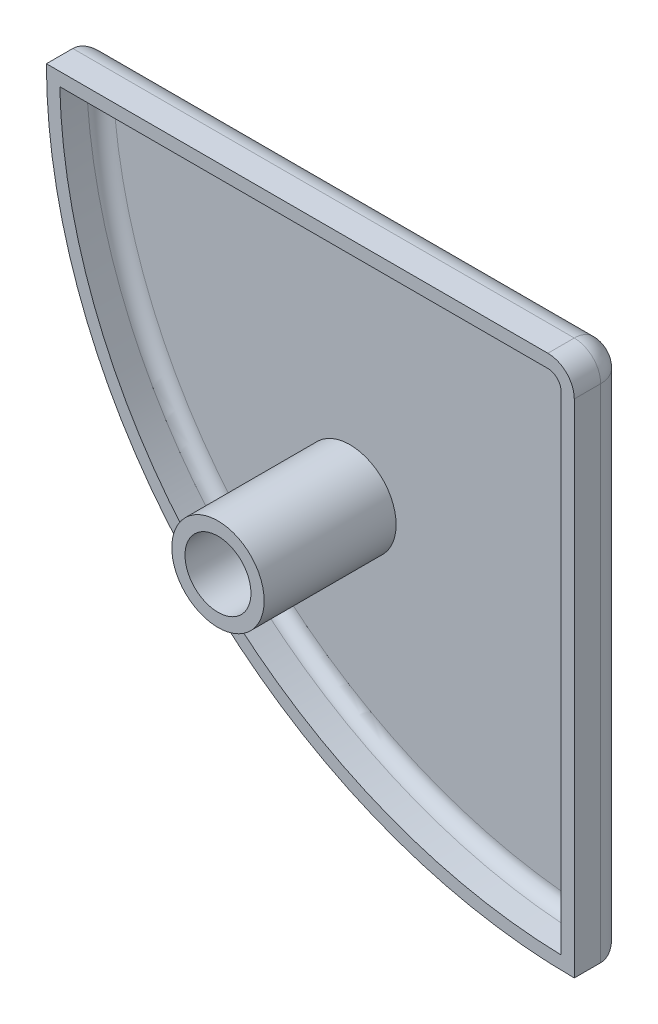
ISO-10303-21;
HEADER;
FILE_DESCRIPTION(('STEP AP214'),'2;1');
FILE_NAME('part.step','',(''),(''),'','','');
FILE_SCHEMA(('AUTOMOTIVE_DESIGN { 1 0 10303 214 1 1 1 1 }'));
ENDSEC;
DATA;
#1=APPLICATION_CONTEXT('core data for automotive mechanical design processes');
#2=APPLICATION_PROTOCOL_DEFINITION('international standard','automotive_design',2000,#1);
#3=PRODUCT_CONTEXT('',#1,'mechanical');
#4=PRODUCT('Part','Part','',(#3));
#5=PRODUCT_RELATED_PRODUCT_CATEGORY('part','',(#4));
#6=PRODUCT_DEFINITION_FORMATION('','',#4);
#7=PRODUCT_DEFINITION_CONTEXT('part definition',#1,'design');
#8=PRODUCT_DEFINITION('design','',#6,#7);
#9=PRODUCT_DEFINITION_SHAPE('','',#8);
#10=(LENGTH_UNIT() NAMED_UNIT(*) SI_UNIT(.MILLI.,.METRE.));
#11=(NAMED_UNIT(*) PLANE_ANGLE_UNIT() SI_UNIT($,.RADIAN.));
#12=(NAMED_UNIT(*) SI_UNIT($,.STERADIAN.) SOLID_ANGLE_UNIT());
#13=UNCERTAINTY_MEASURE_WITH_UNIT(LENGTH_MEASURE(1.E-05),#10,'distance_accuracy_value','');
#14=(GEOMETRIC_REPRESENTATION_CONTEXT(3) GLOBAL_UNCERTAINTY_ASSIGNED_CONTEXT((#13)) GLOBAL_UNIT_ASSIGNED_CONTEXT((#10,
#11,#12)) REPRESENTATION_CONTEXT('',''));
#15=CARTESIAN_POINT('',(0.,0.,0.));
#16=DIRECTION('',(0.,0.,1.));
#17=DIRECTION('',(1.,0.,0.));
#18=AXIS2_PLACEMENT_3D('',#15,#16,#17);
#19=CARTESIAN_POINT('',(20.,20.,-1.));
#20=DIRECTION('',(0.,0.,1.));
#21=DIRECTION('',(1.,0.,0.));
#22=AXIS2_PLACEMENT_3D('',#19,#20,#21);
#23=PLANE('',#22);
#24=DIRECTION('',(0.,1.,0.));
#25=VECTOR('',#24,1.);
#26=CARTESIAN_POINT('',(18.,20.,-1.));
#27=LINE('',#26,#25);
#28=CARTESIAN_POINT('',(18.,18.,-1.));
#29=VERTEX_POINT('',#28);
#30=CARTESIAN_POINT('',(18.,-17.9473319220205,-1.));
#31=VERTEX_POINT('',#30);
#32=EDGE_CURVE('E287',#29,#31,#27,.F.);
#33=ORIENTED_EDGE('',*,*,#32,.F.);
#34=DIRECTION('',(1.,0.,0.));
#35=VECTOR('',#34,1.);
#36=CARTESIAN_POINT('',(20.,18.,-1.));
#37=LINE('',#36,#35);
#38=CARTESIAN_POINT('',(-17.9473319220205,18.,-1.));
#39=VERTEX_POINT('',#38);
#40=EDGE_CURVE('E499',#39,#29,#37,.T.);
#41=ORIENTED_EDGE('',*,*,#40,.F.);
#42=CARTESIAN_POINT('',(20.,20.,-1.));
#43=DIRECTION('',(0.,0.,1.));
#44=DIRECTION('',(1.,0.,0.));
#45=AXIS2_PLACEMENT_3D('',#42,#43,#44);
#46=CIRCLE('',#45,38.);
#47=EDGE_CURVE('E140',#31,#39,#46,.F.);
#48=ORIENTED_EDGE('',*,*,#47,.F.);
#49=EDGE_LOOP('',(#33,#41,#48));
#50=FACE_BOUND('',#49,.T.);
#51=CARTESIAN_POINT('',(0.,0.,-1.));
#52=DIRECTION('',(0.,0.,1.));
#53=DIRECTION('',(1.,0.,0.));
#54=AXIS2_PLACEMENT_3D('',#51,#52,#53);
#55=CIRCLE('',#54,3.5);
#56=CARTESIAN_POINT('',(3.5,0.,-1.));
#57=VERTEX_POINT('',#56);
#58=EDGE_CURVE('E290',#57,#57,#55,.T.);
#59=ORIENTED_EDGE('',*,*,#58,.F.);
#60=EDGE_LOOP('',(#59));
#61=FACE_BOUND('',#60,.T.);
#62=ADVANCED_FACE('F33',(#50,#61),#23,.T.);
#63=CARTESIAN_POINT('',(20.,20.,2.));
#64=DIRECTION('',(0.,0.,-1.));
#65=DIRECTION('',(-1.,0.,0.));
#66=AXIS2_PLACEMENT_3D('',#63,#64,#65);
#67=CYLINDRICAL_SURFACE('',#66,40.);
#68=DIRECTION('',(0.,0.,-1.));
#69=VECTOR('',#68,1.);
#70=CARTESIAN_POINT('',(-20.,20.,2.));
#71=LINE('',#70,#69);
#72=CARTESIAN_POINT('',(-20.,20.,2.));
#73=VERTEX_POINT('',#72);
#74=CARTESIAN_POINT('',(-20.,20.,0.));
#75=VERTEX_POINT('',#74);
#76=EDGE_CURVE('E481',#73,#75,#71,.T.);
#77=ORIENTED_EDGE('',*,*,#76,.T.);
#78=CARTESIAN_POINT('',(20.,20.,0.));
#79=DIRECTION('',(0.,0.,1.));
#80=DIRECTION('',(1.,0.,0.));
#81=AXIS2_PLACEMENT_3D('',#78,#79,#80);
#82=CIRCLE('',#81,40.);
#83=CARTESIAN_POINT('',(20.,-20.,0.));
#84=VERTEX_POINT('',#83);
#85=EDGE_CURVE('E455',#75,#84,#82,.T.);
#86=ORIENTED_EDGE('',*,*,#85,.T.);
#87=DIRECTION('',(0.,0.,-1.));
#88=VECTOR('',#87,1.);
#89=CARTESIAN_POINT('',(20.,-20.,2.));
#90=LINE('',#89,#88);
#91=CARTESIAN_POINT('',(20.,-20.,2.));
#92=VERTEX_POINT('',#91);
#93=EDGE_CURVE('E490',#92,#84,#90,.T.);
#94=ORIENTED_EDGE('',*,*,#93,.F.);
#95=CARTESIAN_POINT('',(20.,20.,2.));
#96=DIRECTION('',(0.,0.,1.));
#97=DIRECTION('',(1.,0.,0.));
#98=AXIS2_PLACEMENT_3D('',#95,#96,#97);
#99=CIRCLE('',#98,40.);
#100=EDGE_CURVE('E487',#73,#92,#99,.T.);
#101=ORIENTED_EDGE('',*,*,#100,.F.);
#102=EDGE_LOOP('',(#77,#86,#94,#101));
#103=FACE_BOUND('',#102,.T.);
#104=ADVANCED_FACE('F240',(#103),#67,.T.);
#105=CARTESIAN_POINT('',(20.,20.,2.));
#106=DIRECTION('',(-1.,0.,0.));
#107=DIRECTION('',(0.,-1.,0.));
#108=AXIS2_PLACEMENT_3D('',#105,#106,#107);
#109=PLANE('',#108);
#110=ORIENTED_EDGE('',*,*,#93,.T.);
#111=DIRECTION('',(0.,1.,0.));
#112=VECTOR('',#111,1.);
#113=CARTESIAN_POINT('',(20.,20.,0.));
#114=LINE('',#113,#112);
#115=CARTESIAN_POINT('',(20.,18.,0.));
#116=VERTEX_POINT('',#115);
#117=EDGE_CURVE('E466',#84,#116,#114,.T.);
#118=ORIENTED_EDGE('',*,*,#117,.T.);
#119=DIRECTION('',(0.,0.,-1.));
#120=VECTOR('',#119,1.);
#121=CARTESIAN_POINT('',(20.,18.,2.));
#122=LINE('',#121,#120);
#123=CARTESIAN_POINT('',(20.,18.,2.));
#124=VERTEX_POINT('',#123);
#125=EDGE_CURVE('E464',#116,#124,#122,.F.);
#126=ORIENTED_EDGE('',*,*,#125,.T.);
#127=DIRECTION('',(0.,1.,0.));
#128=VECTOR('',#127,1.);
#129=CARTESIAN_POINT('',(20.,20.,2.));
#130=LINE('',#129,#128);
#131=EDGE_CURVE('E478',#92,#124,#130,.T.);
#132=ORIENTED_EDGE('',*,*,#131,.F.);
#133=EDGE_LOOP('',(#110,#118,#126,#132));
#134=FACE_BOUND('',#133,.T.);
#135=ADVANCED_FACE('F237',(#134),#109,.F.);
#136=CARTESIAN_POINT('',(-20.,20.,2.));
#137=DIRECTION('',(0.,-1.,0.));
#138=DIRECTION('',(1.,0.,0.));
#139=AXIS2_PLACEMENT_3D('',#136,#137,#138);
#140=PLANE('',#139);
#141=DIRECTION('',(-1.,0.,0.));
#142=VECTOR('',#141,1.);
#143=CARTESIAN_POINT('',(-20.,20.,2.));
#144=LINE('',#143,#142);
#145=CARTESIAN_POINT('',(18.,20.,2.));
#146=VERTEX_POINT('',#145);
#147=EDGE_CURVE('E476',#146,#73,#144,.T.);
#148=ORIENTED_EDGE('',*,*,#147,.F.);
#149=DIRECTION('',(0.,0.,-1.));
#150=VECTOR('',#149,1.);
#151=CARTESIAN_POINT('',(18.,20.,2.));
#152=LINE('',#151,#150);
#153=CARTESIAN_POINT('',(18.,20.,0.));
#154=VERTEX_POINT('',#153);
#155=EDGE_CURVE('E56',#146,#154,#152,.T.);
#156=ORIENTED_EDGE('',*,*,#155,.T.);
#157=DIRECTION('',(-1.,0.,0.));
#158=VECTOR('',#157,1.);
#159=CARTESIAN_POINT('',(-20.,20.,0.));
#160=LINE('',#159,#158);
#161=EDGE_CURVE('E471',#154,#75,#160,.T.);
#162=ORIENTED_EDGE('',*,*,#161,.T.);
#163=ORIENTED_EDGE('',*,*,#76,.F.);
#164=EDGE_LOOP('',(#148,#156,#162,#163));
#165=FACE_BOUND('',#164,.T.);
#166=ADVANCED_FACE('F230',(#165),#140,.F.);
#167=CARTESIAN_POINT('',(20.,20.,2.));
#168=DIRECTION('',(0.,0.,1.));
#169=DIRECTION('',(1.,0.,0.));
#170=AXIS2_PLACEMENT_3D('',#167,#168,#169);
#171=PLANE('',#170);
#172=DIRECTION('',(0.,1.,0.));
#173=VECTOR('',#172,1.);
#174=CARTESIAN_POINT('',(19.,20.,2.));
#175=LINE('',#174,#173);
#176=CARTESIAN_POINT('',(19.,-18.9871773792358,2.));
#177=VERTEX_POINT('',#176);
#178=CARTESIAN_POINT('',(19.,18.,2.));
#179=VERTEX_POINT('',#178);
#180=EDGE_CURVE('E137',#177,#179,#175,.T.);
#181=ORIENTED_EDGE('',*,*,#180,.F.);
#182=CARTESIAN_POINT('',(20.,20.,2.));
#183=DIRECTION('',(0.,0.,1.));
#184=DIRECTION('',(1.,0.,0.));
#185=AXIS2_PLACEMENT_3D('',#182,#183,#184);
#186=CIRCLE('',#185,39.);
#187=CARTESIAN_POINT('',(-18.9871773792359,19.,2.));
#188=VERTEX_POINT('',#187);
#189=EDGE_CURVE('E150',#188,#177,#186,.T.);
#190=ORIENTED_EDGE('',*,*,#189,.F.);
#191=DIRECTION('',(-1.,0.,0.));
#192=VECTOR('',#191,1.);
#193=CARTESIAN_POINT('',(-20.,19.,2.));
#194=LINE('',#193,#192);
#195=CARTESIAN_POINT('',(18.,19.,2.));
#196=VERTEX_POINT('',#195);
#197=EDGE_CURVE('E524',#196,#188,#194,.T.);
#198=ORIENTED_EDGE('',*,*,#197,.F.);
#199=CARTESIAN_POINT('',(18.,18.,2.));
#200=DIRECTION('',(0.,0.,1.));
#201=DIRECTION('',(1.,0.,0.));
#202=AXIS2_PLACEMENT_3D('',#199,#200,#201);
#203=CIRCLE('',#202,1.);
#204=EDGE_CURVE('E261',#179,#196,#203,.T.);
#205=ORIENTED_EDGE('',*,*,#204,.F.);
#206=EDGE_LOOP('',(#181,#190,#198,#205));
#207=FACE_BOUND('',#206,.T.);
#208=ORIENTED_EDGE('',*,*,#131,.T.);
#209=CARTESIAN_POINT('',(18.,18.,2.));
#210=DIRECTION('',(0.,0.,1.));
#211=DIRECTION('',(1.,0.,0.));
#212=AXIS2_PLACEMENT_3D('',#209,#210,#211);
#213=CIRCLE('',#212,2.);
#214=EDGE_CURVE('E41',#124,#146,#213,.T.);
#215=ORIENTED_EDGE('',*,*,#214,.T.);
#216=ORIENTED_EDGE('',*,*,#147,.T.);
#217=ORIENTED_EDGE('',*,*,#100,.T.);
#218=EDGE_LOOP('',(#208,#215,#216,#217));
#219=FACE_BOUND('',#218,.T.);
#220=ADVANCED_FACE('F226',(#207,#219),#171,.T.);
#221=CARTESIAN_POINT('',(20.,20.,-2.));
#222=DIRECTION('',(0.,0.,1.));
#223=DIRECTION('',(1.,0.,0.));
#224=AXIS2_PLACEMENT_3D('',#221,#222,#223);
#225=PLANE('',#224);
#226=DIRECTION('',(0.,1.,0.));
#227=VECTOR('',#226,1.);
#228=CARTESIAN_POINT('',(18.,20.,-2.));
#229=LINE('',#228,#227);
#230=CARTESIAN_POINT('',(18.,18.,-2.));
#231=VERTEX_POINT('',#230);
#232=CARTESIAN_POINT('',(18.,-17.9473319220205,-2.));
#233=VERTEX_POINT('',#232);
#234=EDGE_CURVE('E461',#231,#233,#229,.F.);
#235=ORIENTED_EDGE('',*,*,#234,.T.);
#236=CARTESIAN_POINT('',(20.,20.,-2.));
#237=DIRECTION('',(0.,0.,1.));
#238=DIRECTION('',(1.,0.,0.));
#239=AXIS2_PLACEMENT_3D('',#236,#237,#238);
#240=CIRCLE('',#239,38.);
#241=CARTESIAN_POINT('',(-17.9473319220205,18.,-2.));
#242=VERTEX_POINT('',#241);
#243=EDGE_CURVE('E452',#233,#242,#240,.F.);
#244=ORIENTED_EDGE('',*,*,#243,.T.);
#245=DIRECTION('',(-1.,0.,0.));
#246=VECTOR('',#245,1.);
#247=CARTESIAN_POINT('',(20.,18.,-2.));
#248=LINE('',#247,#246);
#249=EDGE_CURVE('E458',#242,#231,#248,.F.);
#250=ORIENTED_EDGE('',*,*,#249,.T.);
#251=EDGE_LOOP('',(#235,#244,#250));
#252=FACE_BOUND('',#251,.T.);
#253=ADVANCED_FACE('F229',(#252),#225,.F.);
#254=CARTESIAN_POINT('',(18.,18.,2.));
#255=DIRECTION('',(0.,0.,-1.));
#256=DIRECTION('',(-1.,0.,0.));
#257=AXIS2_PLACEMENT_3D('',#254,#255,#256);
#258=CYLINDRICAL_SURFACE('',#257,2.);
#259=CARTESIAN_POINT('',(18.,18.,0.));
#260=DIRECTION('',(0.,0.,-1.));
#261=DIRECTION('',(-1.,0.,0.));
#262=AXIS2_PLACEMENT_3D('',#259,#260,#261);
#263=CIRCLE('',#262,2.);
#264=EDGE_CURVE('E485',#154,#116,#263,.T.);
#265=ORIENTED_EDGE('',*,*,#264,.F.);
#266=ORIENTED_EDGE('',*,*,#155,.F.);
#267=ORIENTED_EDGE('',*,*,#214,.F.);
#268=ORIENTED_EDGE('',*,*,#125,.F.);
#269=EDGE_LOOP('',(#265,#266,#267,#268));
#270=FACE_BOUND('',#269,.T.);
#271=ADVANCED_FACE('F35',(#270),#258,.T.);
#272=CARTESIAN_POINT('',(18.,18.,0.));
#273=DIRECTION('',(0.,0.,1.));
#274=DIRECTION('',(1.,0.,0.));
#275=AXIS2_PLACEMENT_3D('',#272,#273,#274);
#276=SPHERICAL_SURFACE('',#275,2.);
#277=CARTESIAN_POINT('',(18.,18.,0.));
#278=DIRECTION('',(0.,1.,0.));
#279=DIRECTION('',(0.,0.,1.));
#280=AXIS2_PLACEMENT_3D('',#277,#278,#279);
#281=CIRCLE('',#280,2.);
#282=EDGE_CURVE('E267',#231,#116,#281,.F.);
#283=ORIENTED_EDGE('',*,*,#282,.F.);
#284=CARTESIAN_POINT('',(18.,18.,0.));
#285=DIRECTION('',(1.,0.,0.));
#286=DIRECTION('',(0.,0.,-1.));
#287=AXIS2_PLACEMENT_3D('',#284,#285,#286);
#288=CIRCLE('',#287,2.);
#289=EDGE_CURVE('E460',#154,#231,#288,.F.);
#290=ORIENTED_EDGE('',*,*,#289,.F.);
#291=ORIENTED_EDGE('',*,*,#264,.T.);
#292=EDGE_LOOP('',(#283,#290,#291));
#293=FACE_BOUND('',#292,.T.);
#294=ADVANCED_FACE('F271',(#293),#276,.T.);
#295=CARTESIAN_POINT('',(-20.,18.,0.));
#296=DIRECTION('',(-1.,0.,0.));
#297=DIRECTION('',(0.,-1.,0.));
#298=AXIS2_PLACEMENT_3D('',#295,#296,#297);
#299=CYLINDRICAL_SURFACE('',#298,2.);
#300=ORIENTED_EDGE('',*,*,#289,.T.);
#301=ORIENTED_EDGE('',*,*,#249,.F.);
#302=CARTESIAN_POINT('',(-20.,20.,0.));
#303=CARTESIAN_POINT('',(-20.0000107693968,20.0000111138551,-0.0447541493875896));
#304=CARTESIAN_POINT('',(-19.9984981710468,19.9984981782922,-0.0894999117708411));
#305=CARTESIAN_POINT('',(-19.9925092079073,19.9925097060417,-0.17855994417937));
#306=CARTESIAN_POINT('',(-19.9880350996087,19.9880364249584,-0.222874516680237));
#307=CARTESIAN_POINT('',(-19.9762553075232,19.9762619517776,-0.310359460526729));
#308=CARTESIAN_POINT('',(-19.9689736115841,19.9689847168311,-0.35353630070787));
#309=CARTESIAN_POINT('',(-19.9517274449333,19.9517556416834,-0.438798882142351));
#310=CARTESIAN_POINT('',(-19.9417626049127,19.9418034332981,-0.480884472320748));
#311=CARTESIAN_POINT('',(-19.9081622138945,19.9082613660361,-0.604839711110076));
#312=CARTESIAN_POINT('',(-19.8807749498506,19.8809401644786,-0.684734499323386));
#313=CARTESIAN_POINT('',(-19.8176020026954,19.818005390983,-0.837698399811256));
#314=CARTESIAN_POINT('',(-19.7817978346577,19.7823735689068,-0.910751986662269));
#315=CARTESIAN_POINT('',(-19.6876433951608,19.6888255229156,-1.07715918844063));
#316=CARTESIAN_POINT('',(-19.6260162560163,19.6277097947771,-1.16686415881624));
#317=CARTESIAN_POINT('',(-19.4931951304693,19.4963502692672,-1.33118485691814));
#318=CARTESIAN_POINT('',(-19.4219832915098,19.4260894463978,-1.40577175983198));
#319=CARTESIAN_POINT('',(-19.2431728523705,19.2501977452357,-1.56728232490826));
#320=CARTESIAN_POINT('',(-19.1323437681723,19.1415900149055,-1.64736805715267));
#321=CARTESIAN_POINT('',(-18.9025791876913,18.9174674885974,-1.78195873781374));
#322=CARTESIAN_POINT('',(-18.7836328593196,18.8019434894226,-1.83642870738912));
#323=CARTESIAN_POINT('',(-18.5470811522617,18.5733021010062,-1.91973150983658));
#324=CARTESIAN_POINT('',(-18.4297065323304,18.4603535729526,-1.94971086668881));
#325=CARTESIAN_POINT('',(-18.1928806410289,18.2335268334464,-1.98964568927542));
#326=CARTESIAN_POINT('',(-18.0734340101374,18.1196509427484,-1.99964122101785));
#327=CARTESIAN_POINT('',(-17.9516607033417,18.0041068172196,-1.99999683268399));
#328=CARTESIAN_POINT('',(-17.9494963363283,18.0020533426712,-1.99999999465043));
#329=CARTESIAN_POINT('',(-17.9473319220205,18.,-2.));
#330=B_SPLINE_CURVE_WITH_KNOTS('',3,(#302,#303,#304,#305,#306,#307,#308,#309,#310,#311,#312,
#313,#314,#315,#316,#317,#318,#319,#320,#321,#322,#323,#324,#325,#326,#327,#328,#329),
.UNSPECIFIED.,.F.,.F.,(4,2,2,2,2,2,2,2,2,2,2,2,2,4),(0.,0.134197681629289,0.268293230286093,
0.401267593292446,0.534260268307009,0.799259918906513,1.06484708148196,1.43722449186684,
1.81030535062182,2.33134050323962,2.8530850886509,3.34872068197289,3.84336156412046,
3.85231204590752),.UNSPECIFIED.);
#331=EDGE_CURVE('E260',#75,#242,#330,.T.);
#332=ORIENTED_EDGE('',*,*,#331,.F.);
#333=ORIENTED_EDGE('',*,*,#161,.F.);
#334=EDGE_LOOP('',(#300,#301,#332,#333));
#335=FACE_BOUND('',#334,.T.);
#336=ADVANCED_FACE('F249',(#335),#299,.T.);
#337=CARTESIAN_POINT('',(18.,20.,0.));
#338=DIRECTION('',(0.,1.,0.));
#339=DIRECTION('',(-1.,0.,0.));
#340=AXIS2_PLACEMENT_3D('',#337,#338,#339);
#341=CYLINDRICAL_SURFACE('',#340,2.);
#342=ORIENTED_EDGE('',*,*,#282,.T.);
#343=ORIENTED_EDGE('',*,*,#117,.F.);
#344=CARTESIAN_POINT('',(20.,-20.,0.));
#345=CARTESIAN_POINT('',(20.0000111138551,-20.0000107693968,-0.0447541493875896));
#346=CARTESIAN_POINT('',(19.9984981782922,-19.9984981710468,-0.089499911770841));
#347=CARTESIAN_POINT('',(19.9925097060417,-19.9925092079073,-0.17855994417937));
#348=CARTESIAN_POINT('',(19.9880364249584,-19.9880350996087,-0.222874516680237));
#349=CARTESIAN_POINT('',(19.9762619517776,-19.9762553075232,-0.310359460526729));
#350=CARTESIAN_POINT('',(19.9689847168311,-19.9689736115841,-0.353536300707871));
#351=CARTESIAN_POINT('',(19.9517556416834,-19.9517274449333,-0.438798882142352));
#352=CARTESIAN_POINT('',(19.9418034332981,-19.9417626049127,-0.480884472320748));
#353=CARTESIAN_POINT('',(19.9082613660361,-19.9081622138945,-0.604839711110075));
#354=CARTESIAN_POINT('',(19.8809401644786,-19.8807749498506,-0.684734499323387));
#355=CARTESIAN_POINT('',(19.818005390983,-19.8176020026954,-0.837698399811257));
#356=CARTESIAN_POINT('',(19.7823735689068,-19.7817978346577,-0.910751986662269));
#357=CARTESIAN_POINT('',(19.6888255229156,-19.6876433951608,-1.07715918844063));
#358=CARTESIAN_POINT('',(19.6277097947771,-19.6260162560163,-1.16686415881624));
#359=CARTESIAN_POINT('',(19.4963502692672,-19.4931951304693,-1.33118485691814));
#360=CARTESIAN_POINT('',(19.4260894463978,-19.4219832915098,-1.40577175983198));
#361=CARTESIAN_POINT('',(19.2501977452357,-19.2431728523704,-1.56728232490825));
#362=CARTESIAN_POINT('',(19.1415900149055,-19.1323437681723,-1.64736805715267));
#363=CARTESIAN_POINT('',(18.9174674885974,-18.9025791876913,-1.78195873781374));
#364=CARTESIAN_POINT('',(18.8019434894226,-18.7836328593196,-1.83642870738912));
#365=CARTESIAN_POINT('',(18.5733021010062,-18.5470811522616,-1.91973150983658));
#366=CARTESIAN_POINT('',(18.4603535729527,-18.4297065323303,-1.94971086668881));
#367=CARTESIAN_POINT('',(18.2335268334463,-18.192880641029,-1.98964568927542));
#368=CARTESIAN_POINT('',(18.119650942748,-18.0734340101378,-1.99964122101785));
#369=CARTESIAN_POINT('',(18.0041068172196,-17.9516607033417,-1.99999683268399));
#370=CARTESIAN_POINT('',(18.0020533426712,-17.9494963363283,-1.99999999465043));
#371=CARTESIAN_POINT('',(18.,-17.9473319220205,-2.));
#372=B_SPLINE_CURVE_WITH_KNOTS('',3,(#344,#345,#346,#347,#348,#349,#350,#351,#352,#353,#354,
#355,#356,#357,#358,#359,#360,#361,#362,#363,#364,#365,#366,#367,#368,#369,#370,#371),
.UNSPECIFIED.,.F.,.F.,(4,2,2,2,2,2,2,2,2,2,2,2,2,4),(0.,0.134197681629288,0.268293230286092,
0.401267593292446,0.534260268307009,0.799259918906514,1.06484708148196,1.43722449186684,
1.81030535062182,2.33134050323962,2.8530850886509,3.34872068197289,3.84336156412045,
3.85231204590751),.UNSPECIFIED.);
#373=EDGE_CURVE('E254',#233,#84,#372,.F.);
#374=ORIENTED_EDGE('',*,*,#373,.F.);
#375=ORIENTED_EDGE('',*,*,#234,.F.);
#376=EDGE_LOOP('',(#342,#343,#374,#375));
#377=FACE_BOUND('',#376,.T.);
#378=ADVANCED_FACE('F245',(#377),#341,.T.);
#379=CARTESIAN_POINT('',(20.,20.,0.));
#380=DIRECTION('',(0.,0.,1.));
#381=DIRECTION('',(1.,0.,0.));
#382=AXIS2_PLACEMENT_3D('',#379,#380,#381);
#383=TOROIDAL_SURFACE('',#382,38.,2.);
#384=ORIENTED_EDGE('',*,*,#331,.T.);
#385=ORIENTED_EDGE('',*,*,#243,.F.);
#386=ORIENTED_EDGE('',*,*,#373,.T.);
#387=ORIENTED_EDGE('',*,*,#85,.F.);
#388=EDGE_LOOP('',(#384,#385,#386,#387));
#389=FACE_BOUND('',#388,.T.);
#390=ADVANCED_FACE('F210',(#389),#383,.T.);
#391=CARTESIAN_POINT('',(20.,20.,2.));
#392=DIRECTION('',(0.,0.,-1.));
#393=DIRECTION('',(-1.,0.,0.));
#394=AXIS2_PLACEMENT_3D('',#391,#392,#393);
#395=CYLINDRICAL_SURFACE('',#394,39.);
#396=DIRECTION('',(0.,0.,-1.));
#397=VECTOR('',#396,1.);
#398=CARTESIAN_POINT('',(-18.9871773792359,19.,2.));
#399=LINE('',#398,#397);
#400=CARTESIAN_POINT('',(-18.9871773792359,19.,0.));
#401=VERTEX_POINT('',#400);
#402=EDGE_CURVE('E48',#188,#401,#399,.T.);
#403=ORIENTED_EDGE('',*,*,#402,.F.);
#404=ORIENTED_EDGE('',*,*,#189,.T.);
#405=DIRECTION('',(0.,0.,-1.));
#406=VECTOR('',#405,1.);
#407=CARTESIAN_POINT('',(19.,-18.9871773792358,2.));
#408=LINE('',#407,#406);
#409=CARTESIAN_POINT('',(19.,-18.9871773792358,0.));
#410=VERTEX_POINT('',#409);
#411=EDGE_CURVE('E515',#177,#410,#408,.T.);
#412=ORIENTED_EDGE('',*,*,#411,.T.);
#413=CARTESIAN_POINT('',(20.,20.,0.));
#414=DIRECTION('',(0.,0.,-1.));
#415=DIRECTION('',(-1.,0.,0.));
#416=AXIS2_PLACEMENT_3D('',#413,#414,#415);
#417=CIRCLE('',#416,39.);
#418=EDGE_CURVE('E501',#401,#410,#417,.F.);
#419=ORIENTED_EDGE('',*,*,#418,.F.);
#420=EDGE_LOOP('',(#403,#404,#412,#419));
#421=FACE_BOUND('',#420,.T.);
#422=ADVANCED_FACE('F207',(#421),#395,.F.);
#423=CARTESIAN_POINT('',(19.,20.,2.));
#424=DIRECTION('',(-1.,0.,0.));
#425=DIRECTION('',(0.,-1.,0.));
#426=AXIS2_PLACEMENT_3D('',#423,#424,#425);
#427=PLANE('',#426);
#428=ORIENTED_EDGE('',*,*,#411,.F.);
#429=ORIENTED_EDGE('',*,*,#180,.T.);
#430=DIRECTION('',(0.,0.,1.));
#431=VECTOR('',#430,1.);
#432=CARTESIAN_POINT('',(19.,18.,2.));
#433=LINE('',#432,#431);
#434=CARTESIAN_POINT('',(19.,18.,0.));
#435=VERTEX_POINT('',#434);
#436=EDGE_CURVE('E131',#435,#179,#433,.T.);
#437=ORIENTED_EDGE('',*,*,#436,.F.);
#438=DIRECTION('',(0.,-1.,0.));
#439=VECTOR('',#438,1.);
#440=CARTESIAN_POINT('',(19.,20.,0.));
#441=LINE('',#440,#439);
#442=EDGE_CURVE('E118',#410,#435,#441,.F.);
#443=ORIENTED_EDGE('',*,*,#442,.F.);
#444=EDGE_LOOP('',(#428,#429,#437,#443));
#445=FACE_BOUND('',#444,.T.);
#446=ADVANCED_FACE('F135',(#445),#427,.T.);
#447=CARTESIAN_POINT('',(-20.,19.,2.));
#448=DIRECTION('',(0.,-1.,0.));
#449=DIRECTION('',(1.,0.,0.));
#450=AXIS2_PLACEMENT_3D('',#447,#448,#449);
#451=PLANE('',#450);
#452=ORIENTED_EDGE('',*,*,#197,.T.);
#453=ORIENTED_EDGE('',*,*,#402,.T.);
#454=DIRECTION('',(1.,0.,0.));
#455=VECTOR('',#454,1.);
#456=CARTESIAN_POINT('',(-20.,19.,0.));
#457=LINE('',#456,#455);
#458=CARTESIAN_POINT('',(18.,19.,0.));
#459=VERTEX_POINT('',#458);
#460=EDGE_CURVE('E130',#459,#401,#457,.F.);
#461=ORIENTED_EDGE('',*,*,#460,.F.);
#462=DIRECTION('',(0.,0.,1.));
#463=VECTOR('',#462,1.);
#464=CARTESIAN_POINT('',(18.,19.,2.));
#465=LINE('',#464,#463);
#466=EDGE_CURVE('E146',#196,#459,#465,.F.);
#467=ORIENTED_EDGE('',*,*,#466,.F.);
#468=EDGE_LOOP('',(#452,#453,#461,#467));
#469=FACE_BOUND('',#468,.T.);
#470=ADVANCED_FACE('F213',(#469),#451,.T.);
#471=CARTESIAN_POINT('',(18.,18.,2.));
#472=DIRECTION('',(0.,0.,-1.));
#473=DIRECTION('',(-1.,0.,0.));
#474=AXIS2_PLACEMENT_3D('',#471,#472,#473);
#475=CYLINDRICAL_SURFACE('',#474,1.);
#476=CARTESIAN_POINT('',(18.,18.,0.));
#477=DIRECTION('',(0.,0.,1.));
#478=DIRECTION('',(1.,0.,0.));
#479=AXIS2_PLACEMENT_3D('',#476,#477,#478);
#480=CIRCLE('',#479,1.);
#481=EDGE_CURVE('E143',#459,#435,#480,.F.);
#482=ORIENTED_EDGE('',*,*,#481,.T.);
#483=ORIENTED_EDGE('',*,*,#436,.T.);
#484=ORIENTED_EDGE('',*,*,#204,.T.);
#485=ORIENTED_EDGE('',*,*,#466,.T.);
#486=EDGE_LOOP('',(#482,#483,#484,#485));
#487=FACE_BOUND('',#486,.T.);
#488=ADVANCED_FACE('F144',(#487),#475,.F.);
#489=CARTESIAN_POINT('',(18.,18.,0.));
#490=DIRECTION('',(0.,0.,1.));
#491=DIRECTION('',(1.,0.,0.));
#492=AXIS2_PLACEMENT_3D('',#489,#490,#491);
#493=SPHERICAL_SURFACE('',#492,1.);
#494=CARTESIAN_POINT('',(18.,18.,0.));
#495=DIRECTION('',(0.,1.,0.));
#496=DIRECTION('',(-1.,0.,0.));
#497=AXIS2_PLACEMENT_3D('',#494,#495,#496);
#498=CIRCLE('',#497,1.);
#499=EDGE_CURVE('E122',#29,#435,#498,.F.);
#500=ORIENTED_EDGE('',*,*,#499,.T.);
#501=ORIENTED_EDGE('',*,*,#481,.F.);
#502=CARTESIAN_POINT('',(18.,18.,0.));
#503=DIRECTION('',(-1.,0.,0.));
#504=DIRECTION('',(0.,-1.,0.));
#505=AXIS2_PLACEMENT_3D('',#502,#503,#504);
#506=CIRCLE('',#505,1.);
#507=EDGE_CURVE('E151',#459,#29,#506,.T.);
#508=ORIENTED_EDGE('',*,*,#507,.T.);
#509=EDGE_LOOP('',(#500,#501,#508));
#510=FACE_BOUND('',#509,.T.);
#511=ADVANCED_FACE('F153',(#510),#493,.F.);
#512=CARTESIAN_POINT('',(-20.,18.,0.));
#513=DIRECTION('',(-1.,0.,0.));
#514=DIRECTION('',(0.,-1.,0.));
#515=AXIS2_PLACEMENT_3D('',#512,#513,#514);
#516=CYLINDRICAL_SURFACE('',#515,1.);
#517=ORIENTED_EDGE('',*,*,#507,.F.);
#518=ORIENTED_EDGE('',*,*,#460,.T.);
#519=CARTESIAN_POINT('',(-18.9871773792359,19.,0.));
#520=CARTESIAN_POINT('',(-18.9871776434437,19.0000000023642,-0.00311670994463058));
#521=CARTESIAN_POINT('',(-18.9871627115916,18.9999854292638,-0.00623341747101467));
#522=CARTESIAN_POINT('',(-18.9871027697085,18.9999271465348,-0.0124665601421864));
#523=CARTESIAN_POINT('',(-18.9870577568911,18.9998834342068,-0.0155829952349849));
#524=CARTESIAN_POINT('',(-18.9869379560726,18.9997668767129,-0.0218153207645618));
#525=CARTESIAN_POINT('',(-18.9868631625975,18.999694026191,-0.0249312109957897));
#526=CARTESIAN_POINT('',(-18.9866837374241,18.9995192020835,-0.0311621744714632));
#527=CARTESIAN_POINT('',(-18.9865790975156,18.9994172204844,-0.0342772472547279));
#528=CARTESIAN_POINT('',(-18.9863399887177,18.9991841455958,-0.0405063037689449));
#529=CARTESIAN_POINT('',(-18.986205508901,18.9990530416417,-0.0436202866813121));
#530=CARTESIAN_POINT('',(-18.985906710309,18.9987617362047,-0.0498468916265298));
#531=CARTESIAN_POINT('',(-18.9857423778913,18.9986015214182,-0.0529595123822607));
#532=CARTESIAN_POINT('',(-18.9853838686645,18.9982520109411,-0.0591831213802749));
#533=CARTESIAN_POINT('',(-18.9851896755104,18.9980626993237,-0.0622941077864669));
#534=CARTESIAN_POINT('',(-18.9847714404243,18.9976550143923,-0.0685141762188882));
#535=CARTESIAN_POINT('',(-18.9845473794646,18.9974366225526,-0.0716232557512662));
#536=CARTESIAN_POINT('',(-18.9840694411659,18.9969707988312,-0.0778392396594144));
#537=CARTESIAN_POINT('',(-18.9838155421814,18.9967233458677,-0.0809461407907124));
#538=CARTESIAN_POINT('',(-18.9832779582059,18.996199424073,-0.0871574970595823));
#539=CARTESIAN_POINT('',(-18.9829942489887,18.9959229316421,-0.0902619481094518));
#540=CARTESIAN_POINT('',(-18.9823970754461,18.995340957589,-0.0964681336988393));
#541=CARTESIAN_POINT('',(-18.9820835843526,18.9950354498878,-0.0995698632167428));
#542=CARTESIAN_POINT('',(-18.9814268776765,18.9943954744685,-0.105770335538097));
#543=CARTESIAN_POINT('',(-18.9810836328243,18.9940609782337,-0.108869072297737));
#544=CARTESIAN_POINT('',(-18.9803674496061,18.9933630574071,-0.115063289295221));
#545=CARTESIAN_POINT('',(-18.9799944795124,18.9929996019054,-0.118158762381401));
#546=CARTESIAN_POINT('',(-18.9792188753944,18.9922437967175,-0.124346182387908));
#547=CARTESIAN_POINT('',(-18.9788162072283,18.9918514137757,-0.127438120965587));
#548=CARTESIAN_POINT('',(-18.9779812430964,18.9910377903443,-0.133618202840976));
#549=CARTESIAN_POINT('',(-18.9775489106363,18.9906165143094,-0.136706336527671));
#550=CARTESIAN_POINT('',(-18.9766546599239,18.9897451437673,-0.142878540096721));
#551=CARTESIAN_POINT('',(-18.9761927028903,18.9892950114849,-0.145962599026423));
#552=CARTESIAN_POINT('',(-18.9752392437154,18.988365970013,-0.152126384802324));
#553=CARTESIAN_POINT('',(-18.9747477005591,18.9878870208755,-0.155206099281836));
#554=CARTESIAN_POINT('',(-18.9737351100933,18.9869003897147,-0.161360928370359));
#555=CARTESIAN_POINT('',(-18.973214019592,18.9863926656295,-0.164436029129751));
#556=CARTESIAN_POINT('',(-18.9721423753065,18.985348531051,-0.170581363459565));
#557=CARTESIAN_POINT('',(-18.9715917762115,18.9848120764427,-0.17365158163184));
#558=CARTESIAN_POINT('',(-18.9704611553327,18.9837105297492,-0.179786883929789));
#559=CARTESIAN_POINT('',(-18.9698810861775,18.9831453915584,-0.182851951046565));
#560=CARTESIAN_POINT('',(-18.9686915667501,18.9819865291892,-0.188976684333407));
#561=CARTESIAN_POINT('',(-18.9680820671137,18.9813927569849,-0.192036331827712));
#562=CARTESIAN_POINT('',(-18.9668337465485,18.9801766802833,-0.198149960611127));
#563=CARTESIAN_POINT('',(-18.9661948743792,18.9795543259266,-0.201203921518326));
#564=CARTESIAN_POINT('',(-18.9648878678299,18.9782811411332,-0.207305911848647));
#565=CARTESIAN_POINT('',(-18.9642196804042,18.9776302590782,-0.21035391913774));
#566=CARTESIAN_POINT('',(-18.9628541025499,18.9763000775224,-0.216443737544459));
#567=CARTESIAN_POINT('',(-18.962156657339,18.9756207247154,-0.219485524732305));
#568=CARTESIAN_POINT('',(-18.9607326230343,18.9742336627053,-0.225562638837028));
#569=CARTESIAN_POINT('',(-18.9600059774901,18.9735258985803,-0.228597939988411));
#570=CARTESIAN_POINT('',(-18.9585236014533,18.9720820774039,-0.234661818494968));
#571=CARTESIAN_POINT('',(-18.9577678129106,18.9713459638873,-0.237690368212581));
#572=CARTESIAN_POINT('',(-18.9562272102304,18.9698455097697,-0.243740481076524));
#573=CARTESIAN_POINT('',(-18.9554423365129,18.9690811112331,-0.246762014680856));
#574=CARTESIAN_POINT('',(-18.9538436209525,18.9675241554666,-0.252797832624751));
#575=CARTESIAN_POINT('',(-18.953029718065,18.9667315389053,-0.255812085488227));
#576=CARTESIAN_POINT('',(-18.951373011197,18.96511821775,-0.261833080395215));
#577=CARTESIAN_POINT('',(-18.950530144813,18.9642974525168,-0.26483978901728));
#578=CARTESIAN_POINT('',(-18.9488155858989,18.9626279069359,-0.270845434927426));
#579=CARTESIAN_POINT('',(-18.9479438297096,18.961779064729,-0.273844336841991));
#580=CARTESIAN_POINT('',(-18.9461715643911,18.9600534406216,-0.279834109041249));
#581=CARTESIAN_POINT('',(-18.9452709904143,18.9591765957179,-0.282824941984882));
#582=CARTESIAN_POINT('',(-18.9434411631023,18.9573950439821,-0.288798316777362));
#583=CARTESIAN_POINT('',(-18.9425118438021,18.9564902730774,-0.291780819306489));
#584=CARTESIAN_POINT('',(-18.9406245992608,18.9546529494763,-0.29773727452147));
#585=CARTESIAN_POINT('',(-18.9396666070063,18.9537203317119,-0.300711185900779));
#586=CARTESIAN_POINT('',(-18.9377220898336,18.9518273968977,-0.306650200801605));
#587=CARTESIAN_POINT('',(-18.9367354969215,18.9508670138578,-0.309615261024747));
#588=CARTESIAN_POINT('',(-18.934733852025,18.9489186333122,-0.315536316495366));
#589=CARTESIAN_POINT('',(-18.9337187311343,18.947930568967,-0.318492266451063));
#590=CARTESIAN_POINT('',(-18.9316601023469,18.9459269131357,-0.324394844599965));
#591=CARTESIAN_POINT('',(-18.9306165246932,18.9449112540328,-0.327341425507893));
#592=CARTESIAN_POINT('',(-18.9285010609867,18.9428524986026,-0.333225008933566));
#593=CARTESIAN_POINT('',(-18.9274291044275,18.9418093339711,-0.336161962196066));
#594=CARTESIAN_POINT('',(-18.9252569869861,18.9396956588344,-0.34202603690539));
#595=CARTESIAN_POINT('',(-18.9241567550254,18.9386250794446,-0.344953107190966));
#596=CARTESIAN_POINT('',(-18.9219281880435,18.9364566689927,-0.35079716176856));
#597=CARTESIAN_POINT('',(-18.9207997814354,18.9353587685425,-0.353714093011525));
#598=CARTESIAN_POINT('',(-18.9185149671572,18.9331358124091,-0.359537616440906));
#599=CARTESIAN_POINT('',(-18.9173584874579,18.9320106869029,-0.36244415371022));
#600=CARTESIAN_POINT('',(-18.9150176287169,18.9297333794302,-0.368246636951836));
#601=CARTESIAN_POINT('',(-18.9138331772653,18.9285811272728,-0.37114252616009));
#602=CARTESIAN_POINT('',(-18.9114364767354,18.9262496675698,-0.3769234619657));
#603=CARTESIAN_POINT('',(-18.9102241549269,18.9250703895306,-0.379808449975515));
#604=CARTESIAN_POINT('',(-18.907771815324,18.9226849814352,-0.385567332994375));
#605=CARTESIAN_POINT('',(-18.906531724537,18.9214787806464,-0.388441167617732));
#606=CARTESIAN_POINT('',(-18.9040239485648,18.9190396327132,-0.394177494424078));
#607=CARTESIAN_POINT('',(-18.9027561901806,18.9178066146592,-0.397039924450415));
#608=CARTESIAN_POINT('',(-18.9001931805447,18.9153139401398,-0.402753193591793));
#609=CARTESIAN_POINT('',(-18.8988978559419,18.9140542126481,-0.405603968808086));
#610=CARTESIAN_POINT('',(-18.896279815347,18.9115082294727,-0.411293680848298));
#611=CARTESIAN_POINT('',(-18.8949570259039,18.9102219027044,-0.414132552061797));
#612=CARTESIAN_POINT('',(-18.892284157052,18.9076228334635,-0.419798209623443));
#613=CARTESIAN_POINT('',(-18.8909340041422,18.9063100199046,-0.422624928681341));
#614=CARTESIAN_POINT('',(-18.8882065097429,18.9036580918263,-0.42826603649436));
#615=CARTESIAN_POINT('',(-18.8868290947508,18.9023189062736,-0.431080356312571));
#616=CARTESIAN_POINT('',(-18.8840471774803,18.8996143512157,-0.436696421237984));
#617=CARTESIAN_POINT('',(-18.8826426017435,18.8982489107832,-0.439498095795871));
#618=CARTESIAN_POINT('',(-18.8798064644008,18.8954919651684,-0.445088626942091));
#619=CARTESIAN_POINT('',(-18.8783748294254,18.8941003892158,-0.447877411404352));
#620=CARTESIAN_POINT('',(-18.8754846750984,18.8912912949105,-0.453441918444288));
#621=CARTESIAN_POINT('',(-18.8740260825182,18.8898737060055,-0.456217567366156));
#622=CARTESIAN_POINT('',(-18.8710821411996,18.8870127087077,-0.461755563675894));
#623=CARTESIAN_POINT('',(-18.8695967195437,18.8855692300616,-0.46451783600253));
#624=CARTESIAN_POINT('',(-18.8665992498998,18.8826565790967,-0.470028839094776));
#625=CARTESIAN_POINT('',(-18.8650871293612,18.8811873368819,-0.472777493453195));
#626=CARTESIAN_POINT('',(-18.8620363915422,18.8782232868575,-0.478261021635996));
#627=CARTESIAN_POINT('',(-18.8604977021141,18.8767284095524,-0.480995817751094));
#628=CARTESIAN_POINT('',(-18.8573939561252,18.8737132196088,-0.486451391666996));
#629=CARTESIAN_POINT('',(-18.8558288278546,18.8721928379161,-0.489172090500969));
#630=CARTESIAN_POINT('',(-18.852672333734,18.8691267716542,-0.494599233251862));
#631=CARTESIAN_POINT('',(-18.8510808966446,18.8675810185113,-0.497305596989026));
#632=CARTESIAN_POINT('',(-18.8478719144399,18.8644643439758,-0.502703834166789));
#633=CARTESIAN_POINT('',(-18.8462542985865,18.8628933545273,-0.505395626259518));
#634=CARTESIAN_POINT('',(-18.8429930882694,18.8597263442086,-0.510764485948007));
#635=CARTESIAN_POINT('',(-18.8413494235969,18.8581302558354,-0.513441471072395));
#636=CARTESIAN_POINT('',(-18.8380362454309,18.8549131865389,-0.518780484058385));
#637=CARTESIAN_POINT('',(-18.8363666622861,18.8532921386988,-0.521442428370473));
#638=CARTESIAN_POINT('',(-18.8330017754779,18.8500252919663,-0.526751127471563));
#639=CARTESIAN_POINT('',(-18.8313064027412,18.848379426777,-0.52939779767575));
#640=CARTESIAN_POINT('',(-18.8278900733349,18.8450630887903,-0.534675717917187));
#641=CARTESIAN_POINT('',(-18.826169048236,18.8433925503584,-0.537306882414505));
#642=CARTESIAN_POINT('',(-18.8227015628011,18.8400270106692,-0.542553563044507));
#643=CARTESIAN_POINT('',(-18.820955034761,18.8383319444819,-0.545168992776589));
#644=CARTESIAN_POINT('',(-18.8174366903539,18.8349174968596,-0.550383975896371));
#645=CARTESIAN_POINT('',(-18.8156648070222,18.8331980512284,-0.552983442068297));
#646=CARTESIAN_POINT('',(-18.8120958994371,18.8297349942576,-0.558166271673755));
#647=CARTESIAN_POINT('',(-18.8102988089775,18.8279913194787,-0.56074954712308));
#648=CARTESIAN_POINT('',(-18.806679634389,18.8244799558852,-0.565899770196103));
#649=CARTESIAN_POINT('',(-18.8048574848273,18.8227122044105,-0.568466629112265));
#650=CARTESIAN_POINT('',(-18.8011883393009,18.8191528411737,-0.573583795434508));
#651=CARTESIAN_POINT('',(-18.799341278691,18.8173611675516,-0.576134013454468));
#652=CARTESIAN_POINT('',(-18.7956224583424,18.81375411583,-0.581217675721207));
#653=CARTESIAN_POINT('',(-18.7937506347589,18.8119386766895,-0.583751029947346));
#654=CARTESIAN_POINT('',(-18.7899824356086,18.8082842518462,-0.588800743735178));
#655=CARTESIAN_POINT('',(-18.7880859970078,18.8064452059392,-0.591317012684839));
#656=CARTESIAN_POINT('',(-18.7842687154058,18.8027437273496,-0.596332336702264));
#657=CARTESIAN_POINT('',(-18.7823478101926,18.8008812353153,-0.59883130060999));
#658=CARTESIAN_POINT('',(-18.7784817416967,18.797133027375,-0.603811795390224));
#659=CARTESIAN_POINT('',(-18.7765365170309,18.7952472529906,-0.606293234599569));
#660=CARTESIAN_POINT('',(-18.7726219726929,18.7914526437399,-0.611238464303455));
#661=CARTESIAN_POINT('',(-18.7706525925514,18.7895437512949,-0.613702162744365));
#662=CARTESIAN_POINT('',(-18.7666899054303,18.7857030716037,-0.618611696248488));
#663=CARTESIAN_POINT('',(-18.7646965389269,18.7837712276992,-0.621057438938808));
#664=CARTESIAN_POINT('',(-18.7606860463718,18.7798848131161,-0.625930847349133));
#665=CARTESIAN_POINT('',(-18.758668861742,18.7779301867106,-0.628358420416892));
#666=CARTESIAN_POINT('',(-18.7546109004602,18.7739983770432,-0.633195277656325));
#667=CARTESIAN_POINT('',(-18.7525700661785,18.7720211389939,-0.635604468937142));
#668=CARTESIAN_POINT('',(-18.7484649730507,18.7680442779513,-0.640404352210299));
#669=CARTESIAN_POINT('',(-18.7464006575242,18.7660446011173,-0.642794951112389));
#670=CARTESIAN_POINT('',(-18.7422487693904,18.7620230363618,-0.647557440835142));
#671=CARTESIAN_POINT('',(-18.7401611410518,18.7600010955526,-0.649929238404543));
#672=CARTESIAN_POINT('',(-18.7359627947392,18.7559351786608,-0.654653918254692));
#673=CARTESIAN_POINT('',(-18.7338520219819,18.7538911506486,-0.657006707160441));
#674=CARTESIAN_POINT('',(-18.7296075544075,18.7497812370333,-0.661693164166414));
#675=CARTESIAN_POINT('',(-18.7274738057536,18.7477153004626,-0.664026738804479));
#676=CARTESIAN_POINT('',(-18.7231835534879,18.7435617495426,-0.668674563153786));
#677=CARTESIAN_POINT('',(-18.7210269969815,18.7414740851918,-0.670988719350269));
#678=CARTESIAN_POINT('',(-18.7166912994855,18.7372772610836,-0.675597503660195));
#679=CARTESIAN_POINT('',(-18.7145121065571,18.7351680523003,-0.677892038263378));
#680=CARTESIAN_POINT('',(-18.7101313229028,18.7309283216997,-0.682461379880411));
#681=CARTESIAN_POINT('',(-18.7079296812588,18.7287977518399,-0.684736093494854));
#682=CARTESIAN_POINT('',(-18.7035041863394,18.7245154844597,-0.689265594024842));
#683=CARTESIAN_POINT('',(-18.7012802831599,18.7223637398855,-0.691520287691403));
#684=CARTESIAN_POINT('',(-18.6968104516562,18.7180393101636,-0.696009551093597));
#685=CARTESIAN_POINT('',(-18.6945644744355,18.7158665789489,-0.698244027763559));
#686=CARTESIAN_POINT('',(-18.6900506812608,18.7115003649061,-0.702692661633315));
#687=CARTESIAN_POINT('',(-18.6877828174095,18.7093068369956,-0.704906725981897));
#688=CARTESIAN_POINT('',(-18.6832254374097,18.7048992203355,-0.709314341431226));
#689=CARTESIAN_POINT('',(-18.6809358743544,18.7026850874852,-0.7115077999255));
#690=CARTESIAN_POINT('',(-18.6763352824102,18.6982364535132,-0.715874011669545));
#691=CARTESIAN_POINT('',(-18.674024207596,18.6960019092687,-0.718046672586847));
#692=CARTESIAN_POINT('',(-18.669380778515,18.6915126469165,-0.722371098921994));
#693=CARTESIAN_POINT('',(-18.6670483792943,18.68925788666,-0.724522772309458));
#694=CARTESIAN_POINT('',(-18.6623624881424,18.684728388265,-0.728805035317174));
#695=CARTESIAN_POINT('',(-18.6600089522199,18.6824536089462,-0.730935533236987));
#696=CARTESIAN_POINT('',(-18.6552809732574,18.6778842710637,-0.735175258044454));
#697=CARTESIAN_POINT('',(-18.6529064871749,18.6755896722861,-0.737284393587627));
#698=CARTESIAN_POINT('',(-18.648136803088,18.670980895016,-0.74148120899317));
#699=CARTESIAN_POINT('',(-18.6457415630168,18.6686666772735,-0.743568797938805));
#700=CARTESIAN_POINT('',(-18.6409305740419,18.664018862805,-0.747722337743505));
#701=CARTESIAN_POINT('',(-18.638514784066,18.6616852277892,-0.749788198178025));
#702=CARTESIAN_POINT('',(-18.6336628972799,18.6569987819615,-0.75389809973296));
#703=CARTESIAN_POINT('',(-18.6312267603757,18.654645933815,-0.755942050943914));
#704=CARTESIAN_POINT('',(-18.6263343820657,18.6499212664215,-0.760007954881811));
#705=CARTESIAN_POINT('',(-18.6238781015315,18.6475494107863,-0.762029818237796));
#706=CARTESIAN_POINT('',(-18.6189456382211,18.6427869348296,-0.76605136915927));
#707=CARTESIAN_POINT('',(-18.6164694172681,18.6403962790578,-0.768050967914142));
#708=CARTESIAN_POINT('',(-18.6114972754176,18.6355964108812,-0.772027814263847));
#709=CARTESIAN_POINT('',(-18.6090013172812,18.633187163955,-0.77400497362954));
#710=CARTESIAN_POINT('',(-18.6039899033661,18.6283503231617,-0.777936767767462));
#711=CARTESIAN_POINT('',(-18.6014744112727,18.6259226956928,-0.779891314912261));
#712=CARTESIAN_POINT('',(-18.5964241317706,18.6210493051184,-0.783777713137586));
#713=CARTESIAN_POINT('',(-18.5938893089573,18.6186035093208,-0.785709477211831));
#714=CARTESIAN_POINT('',(-18.5888005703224,18.613693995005,-0.789550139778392));
#715=CARTESIAN_POINT('',(-18.5862466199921,18.6112302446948,-0.791458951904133));
#716=CARTESIAN_POINT('',(-18.5811198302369,18.6062850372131,-0.795253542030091));
#717=CARTESIAN_POINT('',(-18.5785469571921,18.6038035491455,-0.797139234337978));
#718=CARTESIAN_POINT('',(-18.5733825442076,18.5988230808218,-0.800887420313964));
#719=CARTESIAN_POINT('',(-18.5707909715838,18.5963240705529,-0.80274982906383));
#720=CARTESIAN_POINT('',(-18.5655893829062,18.5913087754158,-0.806451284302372));
#721=CARTESIAN_POINT('',(-18.562979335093,18.588792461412,-0.808290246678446));
#722=CARTESIAN_POINT('',(-18.5577410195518,18.5837427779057,-0.811944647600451));
#723=CARTESIAN_POINT('',(-18.5551127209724,18.5812093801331,-0.813760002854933));
#724=CARTESIAN_POINT('',(-18.5498381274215,18.5761257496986,-0.817367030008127));
#725=CARTESIAN_POINT('',(-18.54719180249,18.57357548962,-0.819158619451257));
#726=CARTESIAN_POINT('',(-18.5418813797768,18.5684583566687,-0.822717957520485));
#727=CARTESIAN_POINT('',(-18.5392172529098,18.5658914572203,-0.82448562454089));
#728=CARTESIAN_POINT('',(-18.5338714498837,18.5607412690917,-0.827996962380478));
#729=CARTESIAN_POINT('',(-18.5311897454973,18.5581579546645,-0.829740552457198));
#730=CARTESIAN_POINT('',(-18.5258090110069,18.5529751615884,-0.833203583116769));
#731=CARTESIAN_POINT('',(-18.5231099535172,18.5503756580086,-0.834922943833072));
#732=CARTESIAN_POINT('',(-18.5176947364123,18.5451607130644,-0.838337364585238));
#733=CARTESIAN_POINT('',(-18.5149785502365,18.5425452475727,-0.840032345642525));
#734=CARTESIAN_POINT('',(-18.5095292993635,18.5372986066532,-0.843397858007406));
#735=CARTESIAN_POINT('',(-18.5067962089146,18.5346674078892,-0.845068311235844));
#736=CARTESIAN_POINT('',(-18.5013133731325,18.5293895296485,-0.848384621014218));
#737=CARTESIAN_POINT('',(-18.4985636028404,18.5267428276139,-0.850030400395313));
#738=CARTESIAN_POINT('',(-18.4930476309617,18.5214341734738,-0.853297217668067));
#739=CARTESIAN_POINT('',(-18.4902814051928,18.5187721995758,-0.854918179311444));
#740=CARTESIAN_POINT('',(-18.4847327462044,18.5134332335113,-0.858135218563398));
#741=CARTESIAN_POINT('',(-18.481950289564,18.5107562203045,-0.859731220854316));
#742=CARTESIAN_POINT('',(-18.4763693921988,18.5053874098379,-0.862898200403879));
#743=CARTESIAN_POINT('',(-18.4735709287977,18.5026955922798,-0.864469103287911));
#744=CARTESIAN_POINT('',(-18.467958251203,18.4972974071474,-0.867585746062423));
#745=CARTESIAN_POINT('',(-18.4651440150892,18.4945910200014,-0.869131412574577));
#746=CARTESIAN_POINT('',(-18.4595000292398,18.4891639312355,-0.872197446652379));
#747=CARTESIAN_POINT('',(-18.4566702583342,18.4864432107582,-0.873717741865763));
#748=CARTESIAN_POINT('',(-18.4509954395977,18.4809876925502,-0.876732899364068));
#749=CARTESIAN_POINT('',(-18.4481503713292,18.4782528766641,-0.878227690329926));
#750=CARTESIAN_POINT('',(-18.4424451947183,18.4727694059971,-0.881191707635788));
#751=CARTESIAN_POINT('',(-18.4395850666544,18.4700207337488,-0.882660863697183));
#752=CARTESIAN_POINT('',(-18.4338500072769,18.4645097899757,-0.885573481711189));
#753=CARTESIAN_POINT('',(-18.4309750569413,18.4617475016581,-0.887016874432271));
#754=CARTESIAN_POINT('',(-18.4252105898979,18.4562095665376,-0.889877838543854));
#755=CARTESIAN_POINT('',(-18.4223210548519,18.4534339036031,-0.891295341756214));
#756=CARTESIAN_POINT('',(-18.4165276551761,18.4478694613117,-0.8941044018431));
#757=CARTESIAN_POINT('',(-18.4136237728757,18.445080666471,-0.895495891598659));
#758=CARTESIAN_POINT('',(-18.4078019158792,18.4394902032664,-0.898252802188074));
#759=CARTESIAN_POINT('',(-18.4048839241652,18.4366885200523,-0.899618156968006));
#760=CARTESIAN_POINT('',(-18.3990340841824,18.431072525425,-0.902322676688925));
#761=CARTESIAN_POINT('',(-18.39610221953,18.4282581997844,-0.903661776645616));
#762=CARTESIAN_POINT('',(-18.39022488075,18.4226171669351,-0.906313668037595));
#763=CARTESIAN_POINT('',(-18.3872793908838,18.4197904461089,-0.907626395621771));
#764=CARTESIAN_POINT('',(-18.3813750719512,18.414124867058,-0.910225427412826));
#765=CARTESIAN_POINT('',(-18.378416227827,18.4112859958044,-0.911511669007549));
#766=CARTESIAN_POINT('',(-18.3724854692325,18.4055963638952,-0.914057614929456));
#767=CARTESIAN_POINT('',(-18.3695135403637,18.4027455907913,-0.915317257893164));
#768=CARTESIAN_POINT('',(-18.3635568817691,18.397032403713,-0.917809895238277));
#769=CARTESIAN_POINT('',(-18.3605721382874,18.3941699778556,-0.919042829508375));
#770=CARTESIAN_POINT('',(-18.3545901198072,18.3884337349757,-0.921481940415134));
#771=CARTESIAN_POINT('',(-18.3515928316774,18.3855599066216,-0.922688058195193));
#772=CARTESIAN_POINT('',(-18.3455859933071,18.3798011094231,-0.925073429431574));
#773=CARTESIAN_POINT('',(-18.3425764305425,18.3769161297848,-0.926252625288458));
#774=CARTESIAN_POINT('',(-18.3365453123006,18.3711352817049,-0.928584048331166));
#775=CARTESIAN_POINT('',(-18.3335237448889,18.3682394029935,-0.929736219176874));
#776=CARTESIAN_POINT('',(-18.3274688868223,18.3624370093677,-0.93201349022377));
#777=CARTESIAN_POINT('',(-18.3244355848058,18.3595304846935,-0.933138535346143));
#778=CARTESIAN_POINT('',(-18.3183575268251,18.3537070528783,-0.935361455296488));
#779=CARTESIAN_POINT('',(-18.315312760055,18.350790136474,-0.936459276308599));
#780=CARTESIAN_POINT('',(-18.3092120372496,18.3449461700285,-0.938627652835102));
#781=CARTESIAN_POINT('',(-18.3061560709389,18.342019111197,-0.93969815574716));
#782=CARTESIAN_POINT('',(-18.3000331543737,18.3361551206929,-0.941811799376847));
#783=CARTESIAN_POINT('',(-18.2969661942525,18.3332181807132,-0.942854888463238));
#784=CARTESIAN_POINT('',(-18.2908214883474,18.3273346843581,-0.944913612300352));
#785=CARTESIAN_POINT('',(-18.2877437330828,18.3243881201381,-0.945929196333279));
#786=CARTESIAN_POINT('',(-18.2815776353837,18.3184856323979,-0.947932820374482));
#787=CARTESIAN_POINT('',(-18.2784892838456,18.3155297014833,-0.948920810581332));
#788=CARTESIAN_POINT('',(-18.272302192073,18.3096087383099,-0.950869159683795));
#789=CARTESIAN_POINT('',(-18.2692034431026,18.3066436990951,-0.951829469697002));
#790=CARTESIAN_POINT('',(-18.2629957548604,18.3007047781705,-0.953722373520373));
#791=CARTESIAN_POINT('',(-18.2598868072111,18.2977308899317,-0.954654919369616));
#792=CARTESIAN_POINT('',(-18.2536589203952,18.2917745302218,-0.956492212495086));
#793=CARTESIAN_POINT('',(-18.250539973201,18.2887920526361,-0.957396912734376));
#794=CARTESIAN_POINT('',(-18.2442922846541,18.2828187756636,-0.959178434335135));
#795=CARTESIAN_POINT('',(-18.2411635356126,18.2798279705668,-0.960055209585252));
#796=CARTESIAN_POINT('',(-18.2348964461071,18.2738382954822,-0.961780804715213));
#797=CARTESIAN_POINT('',(-18.2317580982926,18.2708394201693,-0.962629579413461));
#798=CARTESIAN_POINT('',(-18.2254720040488,18.2648338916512,-0.964299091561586));
#799=CARTESIAN_POINT('',(-18.222324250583,18.2618272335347,-0.96511978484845));
#800=CARTESIAN_POINT('',(-18.2160197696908,18.255806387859,-0.966733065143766));
#801=CARTESIAN_POINT('',(-18.2128630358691,18.2527921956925,-0.967525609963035));
#802=CARTESIAN_POINT('',(-18.2065411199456,18.2467565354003,-0.969082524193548));
#803=CARTESIAN_POINT('',(-18.2033759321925,18.243735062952,-0.96984685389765));
#804=CARTESIAN_POINT('',(-18.1970376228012,18.2376851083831,-0.971347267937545));
#805=CARTESIAN_POINT('',(-18.1938644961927,18.2346566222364,-0.972083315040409));
#806=CARTESIAN_POINT('',(-18.1875108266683,18.2285929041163,-0.973527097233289));
#807=CARTESIAN_POINT('',(-18.1843302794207,18.2255576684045,-0.974234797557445));
#808=CARTESIAN_POINT('',(-18.177962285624,18.2194807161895,-0.975621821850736));
#809=CARTESIAN_POINT('',(-18.1747748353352,18.2164389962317,-0.976301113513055));
#810=CARTESIAN_POINT('',(-18.1683935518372,18.2103493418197,-0.977631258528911));
#811=CARTESIAN_POINT('',(-18.1651997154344,18.2073014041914,-0.978282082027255));
#812=CARTESIAN_POINT('',(-18.1588061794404,18.2011995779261,-0.979555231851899));
#813=CARTESIAN_POINT('',(-18.1556064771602,18.198145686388,-0.980177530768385));
#814=CARTESIAN_POINT('',(-18.1492017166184,18.1920322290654,-0.981393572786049));
#815=CARTESIAN_POINT('',(-18.1459966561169,18.1889726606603,-0.98198729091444));
#816=CARTESIAN_POINT('',(-18.1395817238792,18.1828480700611,-0.983146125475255));
#817=CARTESIAN_POINT('',(-18.1363718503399,18.1797830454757,-0.983711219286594));
#818=CARTESIAN_POINT('',(-18.1299474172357,18.1736478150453,-0.984812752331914));
#819=CARTESIAN_POINT('',(-18.1267328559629,18.1705776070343,-0.985349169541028));
#820=CARTESIAN_POINT('',(-18.1202987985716,18.164432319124,-0.986393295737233));
#821=CARTESIAN_POINT('',(-18.1170793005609,18.161357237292,-0.986900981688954));
#822=CARTESIAN_POINT('',(-18.1106351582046,18.155202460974,-0.98788760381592));
#823=CARTESIAN_POINT('',(-18.1074105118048,18.1521227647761,-0.988366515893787));
#824=CARTESIAN_POINT('',(-18.1009558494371,18.1459590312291,-0.98929554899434));
#825=CARTESIAN_POINT('',(-18.0977258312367,18.1428749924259,-0.989745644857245));
#826=CARTESIAN_POINT('',(-18.0912602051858,18.1367028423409,-0.990617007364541));
#827=CARTESIAN_POINT('',(-18.0880245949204,18.1336147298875,-0.991038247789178));
#828=CARTESIAN_POINT('',(-18.0815475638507,18.1274347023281,-0.991851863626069));
#829=CARTESIAN_POINT('',(-18.0783061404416,18.124342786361,-0.992244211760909));
#830=CARTESIAN_POINT('',(-18.0718172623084,18.1181554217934,-0.993000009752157));
#831=CARTESIAN_POINT('',(-18.0685698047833,18.1150599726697,-0.993363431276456));
#832=CARTESIAN_POINT('',(-18.0620686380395,18.1088658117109,-0.994061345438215));
#833=CARTESIAN_POINT('',(-18.0588149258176,18.1057670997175,-0.994395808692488));
#834=CARTESIAN_POINT('',(-18.0523010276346,18.0995666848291,-0.995035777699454));
#835=CARTESIAN_POINT('',(-18.0490408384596,18.0964649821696,-0.99534125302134));
#836=CARTESIAN_POINT('',(-18.0425138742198,18.0902589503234,-0.995923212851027));
#837=CARTESIAN_POINT('',(-18.0392470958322,18.0871546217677,-0.996199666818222));
#838=CARTESIAN_POINT('',(-18.0327077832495,18.0809435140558,-0.996723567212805));
#839=CARTESIAN_POINT('',(-18.0294352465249,18.0778367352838,-0.996970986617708));
#840=CARTESIAN_POINT('',(-18.0228853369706,18.0716210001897,-0.997436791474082));
#841=CARTESIAN_POINT('',(-18.0196079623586,18.0685120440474,-0.997655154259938));
#842=CARTESIAN_POINT('',(-18.013049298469,18.0622922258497,-0.998062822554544));
#843=CARTESIAN_POINT('',(-18.0097680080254,18.0591813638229,-0.99825210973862));
#844=CARTESIAN_POINT('',(-18.0032024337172,18.0529580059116,-0.998601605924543));
#845=CARTESIAN_POINT('',(-17.9999181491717,18.0498455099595,-0.998761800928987));
#846=CARTESIAN_POINT('',(-17.9933475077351,18.0436191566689,-0.999053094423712));
#847=CARTESIAN_POINT('',(-17.9900611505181,18.0405052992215,-0.999184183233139));
#848=CARTESIAN_POINT('',(-17.9834872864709,18.0342764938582,-0.99941724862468));
#849=CARTESIAN_POINT('',(-17.9801997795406,18.031161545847,-0.999519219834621));
#850=CARTESIAN_POINT('',(-17.9736245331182,18.0249308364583,-0.999694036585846));
#851=CARTESIAN_POINT('',(-17.9703367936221,18.0218150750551,-0.999766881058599));
#852=CARTESIAN_POINT('',(-17.9637620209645,18.0155829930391,-0.999883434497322));
#853=CARTESIAN_POINT('',(-17.9604749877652,18.0124666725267,-0.999927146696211));
#854=CARTESIAN_POINT('',(-17.953902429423,18.0062337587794,-0.999985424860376));
#855=CARTESIAN_POINT('',(-17.9506169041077,18.0031171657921,-0.99999999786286));
#856=CARTESIAN_POINT('',(-17.9473319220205,18.,-1.));
#857=B_SPLINE_CURVE_WITH_KNOTS('',3,(#519,#520,#521,#522,#523,#524,#525,#526,#527,#528,#529,
#530,#531,#532,#533,#534,#535,#536,#537,#538,#539,#540,#541,#542,#543,#544,#545,#546,#547,#548,
#549,#550,#551,#552,#553,#554,#555,#556,#557,#558,#559,#560,#561,#562,#563,#564,#565,#566,#567,
#568,#569,#570,#571,#572,#573,#574,#575,#576,#577,#578,#579,#580,#581,#582,#583,#584,#585,#586,
#587,#588,#589,#590,#591,#592,#593,#594,#595,#596,#597,#598,#599,#600,#601,#602,#603,#604,#605,
#606,#607,#608,#609,#610,#611,#612,#613,#614,#615,#616,#617,#618,#619,#620,#621,#622,#623,#624,
#625,#626,#627,#628,#629,#630,#631,#632,#633,#634,#635,#636,#637,#638,#639,#640,#641,#642,#643,
#644,#645,#646,#647,#648,#649,#650,#651,#652,#653,#654,#655,#656,#657,#658,#659,#660,#661,#662,
#663,#664,#665,#666,#667,#668,#669,#670,#671,#672,#673,#674,#675,#676,#677,#678,#679,#680,#681,
#682,#683,#684,#685,#686,#687,#688,#689,#690,#691,#692,#693,#694,#695,#696,#697,#698,#699,#700,
#701,#702,#703,#704,#705,#706,#707,#708,#709,#710,#711,#712,#713,#714,#715,#716,#717,#718,#719,
#720,#721,#722,#723,#724,#725,#726,#727,#728,#729,#730,#731,#732,#733,#734,#735,#736,#737,#738,
#739,#740,#741,#742,#743,#744,#745,#746,#747,#748,#749,#750,#751,#752,#753,#754,#755,#756,#757,
#758,#759,#760,#761,#762,#763,#764,#765,#766,#767,#768,#769,#770,#771,#772,#773,#774,#775,#776,
#777,#778,#779,#780,#781,#782,#783,#784,#785,#786,#787,#788,#789,#790,#791,#792,#793,#794,#795,
#796,#797,#798,#799,#800,#801,#802,#803,#804,#805,#806,#807,#808,#809,#810,#811,#812,#813,#814,
#815,#816,#817,#818,#819,#820,#821,#822,#823,#824,#825,#826,#827,#828,#829,#830,#831,#832,#833,
#834,#835,#836,#837,#838,#839,#840,#841,#842,#843,#844,#845,#846,#847,#848,#849,#850,#851,#852,
#853,#854,#855,#856),.UNSPECIFIED.,.F.,.F.,(4,2,2,2,2,2,2,2,2,2,2,2,2,2,2,2,2,2,2,2,2,2,2,2,2,2,
2,2,2,2,2,2,2,2,2,2,2,2,2,2,2,2,2,2,2,2,2,2,2,2,2,2,2,2,2,2,2,2,2,2,2,2,2,2,2,2,2,2,2,2,2,2,2,2,
2,2,2,2,2,2,2,2,2,2,2,2,2,2,2,2,2,2,2,2,2,2,2,2,2,2,2,2,2,2,2,2,2,2,2,2,2,2,2,2,2,2,2,2,2,2,2,2,
2,2,2,2,2,2,2,2,2,2,2,2,2,2,2,2,2,2,2,2,2,2,2,2,2,2,2,2,2,2,2,2,2,2,2,2,2,2,2,2,2,2,2,2,2,2,4),
(0.,0.00935005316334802,0.0187009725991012,0.0280536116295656,0.0374088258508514,
0.0467674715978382,0.056130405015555,0.0654984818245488,0.0748725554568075,0.0842534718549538,
0.093642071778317,0.103039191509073,0.112445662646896,0.121862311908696,0.131289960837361,
0.140729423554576,0.150181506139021,0.15964700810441,0.169126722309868,0.178621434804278,
0.188131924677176,0.197658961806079,0.207203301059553,0.216765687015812,0.22634685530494,
0.235947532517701,0.245568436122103,0.255210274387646,0.264873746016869,0.274559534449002,
0.284268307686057,0.294000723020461,0.303757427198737,0.313539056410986,0.323346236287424,
0.333179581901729,0.343039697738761,0.352927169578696,0.36284255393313,0.372786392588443,
0.382759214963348,0.392761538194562,0.402793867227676,0.412856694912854,0.422950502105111,
0.433075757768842,0.443232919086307,0.453422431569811,0.463644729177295,0.473900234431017,
0.48418935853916,0.494512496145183,0.504870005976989,0.515262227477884,0.525689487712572,
0.536152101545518,0.546650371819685,0.557184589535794,0.567755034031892,0.578361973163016,
0.589005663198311,0.59968633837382,0.610404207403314,0.621159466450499,0.631952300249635,
0.642782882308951,0.653651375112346,0.664557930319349,0.675502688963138,0.68648578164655,
0.697507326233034,0.708567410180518,0.719666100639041,0.730803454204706,0.741979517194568,
0.753194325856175,0.764447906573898,0.775740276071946,0.787071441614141,0.798441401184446,
0.809850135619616,0.821297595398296,0.832783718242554,0.844308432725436,0.855871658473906,
0.867473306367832,0.879113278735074,0.890791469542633,0.902507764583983,0.914262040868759,
0.92605415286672,0.937883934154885,0.949751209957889,0.961655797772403,0.973597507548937,
0.985576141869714,0.997591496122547,1.00964335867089,1.02173151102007,1.0338557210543,
1.04601572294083,1.0582112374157,1.07044197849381,1.08270765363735,1.09500796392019,
1.1073426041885,1.11971126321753,1.13211362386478,1.14454936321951,1.15701815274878,
1.16951965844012,1.18205354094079,1.19461945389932,1.20721702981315,1.21984588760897,
1.23250564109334,1.24519589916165,1.2579162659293,1.27066634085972,1.28344571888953,
1.2962539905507,1.30909074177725,1.32195553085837,1.33484787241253,1.34776727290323,
1.36071323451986,1.37368525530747,1.38668282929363,1.39970544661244,1.41275259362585,
1.42582375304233,1.43891842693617,1.45203621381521,1.46517673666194,1.47833961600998,
1.49152447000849,1.50473091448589,1.51795856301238,1.5312070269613,1.5444759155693,
1.55776479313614,1.57107281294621,1.58439889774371,1.59774196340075,1.61110092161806,
1.6244746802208,1.63786214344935,1.65126221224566,1.6646737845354,1.6780957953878,
1.69152797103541,1.70497076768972,1.71842466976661,1.73189016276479,1.74536773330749,
1.75885786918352,1.77236105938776,1.785877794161,1.79940856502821,1.81295343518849,
1.82651081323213,1.84007870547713,1.85365511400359,1.86723803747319,1.88082547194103,
1.89441541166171,1.90800584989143,1.92159477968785,1.9351804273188),.UNSPECIFIED.);
#858=EDGE_CURVE('E154',#401,#39,#857,.T.);
#859=ORIENTED_EDGE('',*,*,#858,.T.);
#860=ORIENTED_EDGE('',*,*,#40,.T.);
#861=EDGE_LOOP('',(#517,#518,#859,#860));
#862=FACE_BOUND('',#861,.T.);
#863=ADVANCED_FACE('F181',(#862),#516,.F.);
#864=CARTESIAN_POINT('',(18.,20.,0.));
#865=DIRECTION('',(0.,1.,0.));
#866=DIRECTION('',(-1.,0.,0.));
#867=AXIS2_PLACEMENT_3D('',#864,#865,#866);
#868=CYLINDRICAL_SURFACE('',#867,1.);
#869=ORIENTED_EDGE('',*,*,#499,.F.);
#870=ORIENTED_EDGE('',*,*,#32,.T.);
#871=CARTESIAN_POINT('',(18.,-17.9473319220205,-1.));
#872=CARTESIAN_POINT('',(18.0031171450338,-17.9506169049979,-0.999999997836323));
#873=CARTESIAN_POINT('',(18.006233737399,-17.9539024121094,-0.999985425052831));
#874=CARTESIAN_POINT('',(18.0124666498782,-17.9604748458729,-0.999927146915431));
#875=CARTESIAN_POINT('',(18.015582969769,-17.9637617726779,-0.999883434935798));
#876=CARTESIAN_POINT('',(18.0218150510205,-17.9703362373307,-0.999766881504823));
#877=CARTESIAN_POINT('',(18.024930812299,-17.973623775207,-0.999694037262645));
#878=CARTESIAN_POINT('',(18.0311615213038,-17.9801985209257,-0.999519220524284));
#879=CARTESIAN_POINT('',(18.0342764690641,-17.9834857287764,-0.999417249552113));
#880=CARTESIAN_POINT('',(18.0405052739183,-17.9900588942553,-0.999184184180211));
#881=CARTESIAN_POINT('',(18.0436191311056,-17.993344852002,-0.999053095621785));
#882=CARTESIAN_POINT('',(18.0498454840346,-17.9999145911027,-0.998761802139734));
#883=CARTESIAN_POINT('',(18.0529579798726,-18.0031983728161,-0.998601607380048));
#884=CARTESIAN_POINT('',(18.0591813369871,-18.009762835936,-0.998252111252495));
#885=CARTESIAN_POINT('',(18.0622921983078,-18.0130435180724,-0.998062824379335));
#886=CARTESIAN_POINT('',(18.0685120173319,-18.019600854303,-0.997655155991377));
#887=CARTESIAN_POINT('',(18.0716209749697,-18.0228775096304,-0.997436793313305));
#888=CARTESIAN_POINT('',(18.0778367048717,-18.0294258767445,-0.996970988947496));
#889=CARTESIAN_POINT('',(18.0809434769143,-18.0326975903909,-0.996723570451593));
#890=CARTESIAN_POINT('',(18.0871546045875,-18.0392351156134,-0.996199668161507));
#891=CARTESIAN_POINT('',(18.090258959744,-18.0425009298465,-0.995923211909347));
#892=CARTESIAN_POINT('',(18.0964650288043,-18.0490260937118,-0.995341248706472));
#893=CARTESIAN_POINT('',(18.0995667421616,-18.0522854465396,-0.995035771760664));
#894=CARTESIAN_POINT('',(18.1057671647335,-18.0587979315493,-0.994395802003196));
#895=CARTESIAN_POINT('',(18.1088658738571,-18.0620510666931,-0.994061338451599));
#896=CARTESIAN_POINT('',(18.1150600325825,-18.0685513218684,-0.993363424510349));
#897=CARTESIAN_POINT('',(18.1181554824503,-18.0717984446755,-0.993000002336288));
#898=CARTESIAN_POINT('',(18.1243428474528,-18.0782868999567,-0.99224420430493));
#899=CARTESIAN_POINT('',(18.1274347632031,-18.0815282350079,-0.991851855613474));
#900=CARTESIAN_POINT('',(18.1336147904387,-18.0880053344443,-0.991038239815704));
#901=CARTESIAN_POINT('',(18.1367029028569,-18.0912411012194,-0.990616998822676));
#902=CARTESIAN_POINT('',(18.1428750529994,-18.0977072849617,-0.98974563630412));
#903=CARTESIAN_POINT('',(18.1459590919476,-18.1009377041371,-0.989295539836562));
#904=CARTESIAN_POINT('',(18.1521228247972,-18.1073934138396,-0.988366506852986));
#905=CARTESIAN_POINT('',(18.1552025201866,-18.1106187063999,-0.987887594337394));
#906=CARTESIAN_POINT('',(18.1613572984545,-18.1170643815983,-0.986900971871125));
#907=CARTESIAN_POINT('',(18.1644323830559,-18.1202847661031,-0.986393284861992));
#908=CARTESIAN_POINT('',(18.1705776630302,-18.12672085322,-0.985349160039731));
#909=CARTESIAN_POINT('',(18.1736478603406,-18.1299365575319,-0.984812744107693));
#910=CARTESIAN_POINT('',(18.1797830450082,-18.1363633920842,-0.983711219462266));
#911=CARTESIAN_POINT('',(18.1828480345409,-18.1395745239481,-0.98314613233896));
#912=CARTESIAN_POINT('',(18.1889725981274,-18.1459917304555,-0.981987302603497));
#913=CARTESIAN_POINT('',(18.1920321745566,-18.1491978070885,-0.981393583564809));
#914=CARTESIAN_POINT('',(18.1981456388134,-18.1556044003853,-0.980177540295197));
#915=CARTESIAN_POINT('',(18.2011995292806,-18.1588049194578,-0.979555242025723));
#916=CARTESIAN_POINT('',(18.2073013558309,-18.1651998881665,-0.978282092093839));
#917=CARTESIAN_POINT('',(18.2103492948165,-18.1683943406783,-0.977631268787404));
#918=CARTESIAN_POINT('',(18.216438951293,-18.1747766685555,-0.976301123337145));
#919=CARTESIAN_POINT('',(18.2194806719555,-18.1779645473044,-0.975621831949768));
#920=CARTESIAN_POINT('',(18.2255576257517,-18.1843332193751,-0.974234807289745));
#921=CARTESIAN_POINT('',(18.2285928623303,-18.1875140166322,-0.973527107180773));
#922=CARTESIAN_POINT('',(18.2346565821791,-18.1938680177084,-0.972083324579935));
#923=CARTESIAN_POINT('',(18.2376850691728,-18.1970412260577,-0.971347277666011));
#924=CARTESIAN_POINT('',(18.2437350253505,-18.2033795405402,-0.969846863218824));
#925=CARTESIAN_POINT('',(18.2467564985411,-18.206544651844,-0.969082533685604));
#926=CARTESIAN_POINT('',(18.2527921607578,-18.2128662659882,-0.967525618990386));
#927=CARTESIAN_POINT('',(18.2558063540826,-18.2160227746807,-0.966733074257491));
#928=CARTESIAN_POINT('',(18.2618272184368,-18.2223266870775,-0.965119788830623));
#929=CARTESIAN_POINT('',(18.2648338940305,-18.225474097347,-0.964299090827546));
#930=CARTESIAN_POINT('',(18.2708394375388,-18.2317595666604,-0.962629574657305));
#931=CARTESIAN_POINT('',(18.2738383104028,-18.2348976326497,-0.961780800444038));
#932=CARTESIAN_POINT('',(18.2798279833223,-18.2411642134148,-0.960055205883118));
#933=CARTESIAN_POINT('',(18.282818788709,-18.2442927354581,-0.959178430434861));
#934=CARTESIAN_POINT('',(18.2887920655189,-18.2505400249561,-0.957396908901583));
#935=CARTESIAN_POINT('',(18.2917745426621,-18.2536588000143,-0.956492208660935));
#936=CARTESIAN_POINT('',(18.2977309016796,-18.25988639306,-0.954654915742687));
#937=CARTESIAN_POINT('',(18.3007047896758,-18.2629952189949,-0.953722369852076));
#938=CARTESIAN_POINT('',(18.3066437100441,-18.2692027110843,-0.951829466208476));
#939=CARTESIAN_POINT('',(18.3096087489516,-18.2723013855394,-0.950869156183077));
#940=CARTESIAN_POINT('',(18.315529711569,-18.2784883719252,-0.948920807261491));
#941=CARTESIAN_POINT('',(18.3184856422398,-18.2815766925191,-0.947932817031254));
#942=CARTESIAN_POINT('',(18.3243881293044,-18.2877427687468,-0.945929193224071));
#943=CARTESIAN_POINT('',(18.3273346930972,-18.2908205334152,-0.944913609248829));
#944=CARTESIAN_POINT('',(18.3332181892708,-18.2969652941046,-0.94285488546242));
#945=CARTESIAN_POINT('',(18.3361551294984,-18.3000322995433,-0.941811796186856));
#946=CARTESIAN_POINT('',(18.3420191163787,-18.3061553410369,-0.939698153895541));
#947=CARTESIAN_POINT('',(18.3449461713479,-18.3092113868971,-0.938627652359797));
#948=CARTESIAN_POINT('',(18.3507901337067,-18.3153122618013,-0.936459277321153));
#949=CARTESIAN_POINT('',(18.3537070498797,-18.3183571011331,-0.935361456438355));
#950=CARTESIAN_POINT('',(18.3595304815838,-18.3244352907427,-0.933138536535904));
#951=CARTESIAN_POINT('',(18.3624370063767,-18.3274686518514,-0.932013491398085));
#952=CARTESIAN_POINT('',(18.3682394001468,-18.3335236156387,-0.929736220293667));
#953=CARTESIAN_POINT('',(18.3711352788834,-18.3365452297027,-0.928584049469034));
#954=CARTESIAN_POINT('',(18.3769161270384,-18.3425764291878,-0.926252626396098));
#955=CARTESIAN_POINT('',(18.3798011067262,-18.345586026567,-0.925073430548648));
#956=CARTESIAN_POINT('',(18.3855599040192,-18.3515929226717,-0.92268805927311));
#957=CARTESIAN_POINT('',(18.3884337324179,-18.3545902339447,-0.921481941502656));
#958=CARTESIAN_POINT('',(18.3941699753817,-18.360572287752,-0.919042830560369));
#959=CARTESIAN_POINT('',(18.3970324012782,-18.3635570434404,-0.917809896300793));
#960=CARTESIAN_POINT('',(18.4027455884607,-18.3695137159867,-0.915317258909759));
#961=CARTESIAN_POINT('',(18.4055963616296,-18.3724856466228,-0.914057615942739));
#962=CARTESIAN_POINT('',(18.4112859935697,-18.3784163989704,-0.911511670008));
#963=CARTESIAN_POINT('',(18.4141248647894,-18.3813752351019,-0.910225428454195));
#964=CARTESIAN_POINT('',(18.4197904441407,-18.3872795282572,-0.90762639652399));
#965=CARTESIAN_POINT('',(18.4226171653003,-18.3902250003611,-0.906313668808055));
#966=CARTESIAN_POINT('',(18.4282581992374,-18.3961022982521,-0.903661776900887));
#967=CARTESIAN_POINT('',(18.4310725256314,-18.3990341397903,-0.90232267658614));
#968=CARTESIAN_POINT('',(18.4366885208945,-18.4048839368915,-0.899618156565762));
#969=CARTESIAN_POINT('',(18.4394902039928,-18.4078019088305,-0.898252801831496));
#970=CARTESIAN_POINT('',(18.4450806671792,-18.413623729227,-0.895495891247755));
#971=CARTESIAN_POINT('',(18.4478694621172,-18.4165275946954,-0.894104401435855));
#972=CARTESIAN_POINT('',(18.4534339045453,-18.4223209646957,-0.891295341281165));
#973=CARTESIAN_POINT('',(18.4562095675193,-18.4252104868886,-0.889877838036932));
#974=CARTESIAN_POINT('',(18.4617475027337,-18.4309749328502,-0.887016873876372));
#975=CARTESIAN_POINT('',(18.4645097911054,-18.4338498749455,-0.88557348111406));
#976=CARTESIAN_POINT('',(18.470020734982,-18.4395849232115,-0.882660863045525));
#977=CARTESIAN_POINT('',(18.4727694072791,-18.4424450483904,-0.881191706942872));
#978=CARTESIAN_POINT('',(18.4782528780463,-18.4481502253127,-0.878227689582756));
#979=CARTESIAN_POINT('',(18.4809876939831,-18.4509952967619,-0.876732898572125));
#980=CARTESIAN_POINT('',(18.4864432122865,-18.4566701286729,-0.873717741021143));
#981=CARTESIAN_POINT('',(18.4891639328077,-18.4594999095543,-0.872197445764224));
#982=CARTESIAN_POINT('',(18.4945910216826,-18.4651439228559,-0.869131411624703));
#983=CARTESIAN_POINT('',(18.4972974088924,-18.4679581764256,-0.867585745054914));
#984=CARTESIAN_POINT('',(18.5026955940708,-18.4735708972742,-0.864469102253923));
#985=CARTESIAN_POINT('',(18.50538741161,-18.4763693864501,-0.862898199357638));
#986=CARTESIAN_POINT('',(18.5107562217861,-18.4819503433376,-0.859731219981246));
#987=CARTESIAN_POINT('',(18.5134332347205,-18.4847328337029,-0.858135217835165));
#988=CARTESIAN_POINT('',(18.5187722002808,-18.4902815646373,-0.854918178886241));
#989=CARTESIAN_POINT('',(18.5214341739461,-18.4930478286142,-0.853297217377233));
#990=CARTESIAN_POINT('',(18.5267428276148,-18.4985638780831,-0.850030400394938));
#991=CARTESIAN_POINT('',(18.5293895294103,-18.5013136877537,-0.848384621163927));
#992=CARTESIAN_POINT('',(18.5346674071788,-18.5067966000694,-0.845068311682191));
#993=CARTESIAN_POINT('',(18.5372986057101,-18.5095297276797,-0.843397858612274));
#994=CARTESIAN_POINT('',(18.5425452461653,-18.5149790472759,-0.840032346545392));
#995=CARTESIAN_POINT('',(18.5451607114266,-18.5176952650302,-0.838337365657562));
#996=CARTESIAN_POINT('',(18.5503756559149,-18.5231105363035,-0.834922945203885));
#997=CARTESIAN_POINT('',(18.5529751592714,-18.5258096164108,-0.833203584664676));
#998=CARTESIAN_POINT('',(18.5581579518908,-18.5311903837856,-0.8297405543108));
#999=CARTESIAN_POINT('',(18.5607412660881,-18.5338720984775,-0.827996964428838));
#1000=CARTESIAN_POINT('',(18.5658914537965,-18.5392179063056,-0.82448562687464));
#1001=CARTESIAN_POINT('',(18.5684583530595,-18.5418820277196,-0.822717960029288));
#1002=CARTESIAN_POINT('',(18.5735754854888,-18.5471924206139,-0.819158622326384));
#1003=CARTESIAN_POINT('',(18.5761257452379,-18.5498387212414,-0.817367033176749));
#1004=CARTESIAN_POINT('',(18.5812093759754,-18.555113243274,-0.813760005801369));
#1005=CARTESIAN_POINT('',(18.5837427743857,-18.5577414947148,-0.811944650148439));
#1006=CARTESIAN_POINT('',(18.5887924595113,-18.562979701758,-0.808290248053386));
#1007=CARTESIAN_POINT('',(18.5913087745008,-18.56558968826,-0.806451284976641));
#1008=CARTESIAN_POINT('',(18.5963240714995,-18.5707911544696,-0.802749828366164));
#1009=CARTESIAN_POINT('',(18.5988230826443,-18.5733826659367,-0.800887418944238));
#1010=CARTESIAN_POINT('',(18.6038035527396,-18.5785469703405,-0.797139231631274));
#1011=CARTESIAN_POINT('',(18.6062850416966,-18.5811197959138,-0.795253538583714));
#1012=CARTESIAN_POINT('',(18.6112302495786,-18.5862465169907,-0.791458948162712));
#1013=CARTESIAN_POINT('',(18.6136939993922,-18.5888004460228,-0.789550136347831));
#1014=CARTESIAN_POINT('',(18.618603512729,-18.5938891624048,-0.785709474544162));
#1015=CARTESIAN_POINT('',(18.6210493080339,-18.5964239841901,-0.783777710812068));
#1016=CARTESIAN_POINT('',(18.6259226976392,-18.6014742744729,-0.779891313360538));
#1017=CARTESIAN_POINT('',(18.628350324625,-18.6039897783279,-0.777936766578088));
#1018=CARTESIAN_POINT('',(18.6331871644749,-18.6090012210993,-0.774004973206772));
#1019=CARTESIAN_POINT('',(18.6355964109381,-18.6114971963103,-0.772027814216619));
#1020=CARTESIAN_POINT('',(18.6403962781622,-18.6164693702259,-0.768050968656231));
#1021=CARTESIAN_POINT('',(18.6427869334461,-18.6189456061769,-0.766051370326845));
#1022=CARTESIAN_POINT('',(18.6475494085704,-18.6238780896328,-0.762029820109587));
#1023=CARTESIAN_POINT('',(18.6499212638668,-18.6263343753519,-0.760007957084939));
#1024=CARTESIAN_POINT('',(18.6546459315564,-18.63122674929,-0.755942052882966));
#1025=CARTESIAN_POINT('',(18.6569987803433,-18.6336628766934,-0.753898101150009));
#1026=CARTESIAN_POINT('',(18.6616852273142,-18.638514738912,-0.749788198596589));
#1027=CARTESIAN_POINT('',(18.6640188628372,-18.6409305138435,-0.747722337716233));
#1028=CARTESIAN_POINT('',(18.6686666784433,-18.6457414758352,-0.743568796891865));
#1029=CARTESIAN_POINT('',(18.6709808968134,-18.6481367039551,-0.741481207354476));
#1030=CARTESIAN_POINT('',(18.6755896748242,-18.6529063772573,-0.737284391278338));
#1031=CARTESIAN_POINT('',(18.6778842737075,-18.6552808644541,-0.735175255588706));
#1032=CARTESIAN_POINT('',(18.6824536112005,-18.6600088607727,-0.730935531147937));
#1033=CARTESIAN_POINT('',(18.6847283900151,-18.662362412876,-0.728805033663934));
#1034=CARTESIAN_POINT('',(18.6892578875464,-18.6670483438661,-0.724522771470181));
#1035=CARTESIAN_POINT('',(18.6915126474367,-18.6693807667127,-0.722371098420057));
#1036=CARTESIAN_POINT('',(18.6960019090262,-18.6740242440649,-0.718046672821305));
#1037=CARTESIAN_POINT('',(18.6982364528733,-18.6763353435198,-0.715874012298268));
#1038=CARTESIAN_POINT('',(18.7026850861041,-18.6809359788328,-0.71150780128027));
#1039=CARTESIAN_POINT('',(18.7048992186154,-18.6832255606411,-0.709314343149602));
#1040=CARTESIAN_POINT('',(18.7093068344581,-18.6877829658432,-0.704906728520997));
#1041=CARTESIAN_POINT('',(18.7115003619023,-18.6900508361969,-0.702692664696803));
#1042=CARTESIAN_POINT('',(18.7158665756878,-18.6945646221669,-0.698244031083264));
#1043=CARTESIAN_POINT('',(18.7180393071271,-18.6968105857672,-0.696009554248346));
#1044=CARTESIAN_POINT('',(18.722363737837,-18.7012803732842,-0.69152028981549));
#1045=CARTESIAN_POINT('',(18.7245154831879,-18.7035042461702,-0.689265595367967));
#1046=CARTESIAN_POINT('',(18.7287977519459,-18.7079296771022,-0.684736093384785));
#1047=CARTESIAN_POINT('',(18.7309283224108,-18.710131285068,-0.682461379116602));
#1048=CARTESIAN_POINT('',(18.7351680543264,-18.7145120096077,-0.677892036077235));
#1049=CARTESIAN_POINT('',(18.7372772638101,-18.7166911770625,-0.675597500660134));
#1050=CARTESIAN_POINT('',(18.7414740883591,-18.7210268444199,-0.670988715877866));
#1051=CARTESIAN_POINT('',(18.7435617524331,-18.7231833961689,-0.668674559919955));
#1052=CARTESIAN_POINT('',(18.7477153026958,-18.7274736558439,-0.664026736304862));
#1053=CARTESIAN_POINT('',(18.7497812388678,-18.7296074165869,-0.661693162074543));
#1054=CARTESIAN_POINT('',(18.7538911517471,-18.7338519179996,-0.657006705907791));
#1055=CARTESIAN_POINT('',(18.7559351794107,-18.7359627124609,-0.654653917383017));
#1056=CARTESIAN_POINT('',(18.7600010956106,-18.7401611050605,-0.649929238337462));
#1057=CARTESIAN_POINT('',(18.7620230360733,-18.7422487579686,-0.647557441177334));
#1058=CARTESIAN_POINT('',(18.7660446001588,-18.7464006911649,-0.642794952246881));
#1059=CARTESIAN_POINT('',(18.7680442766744,-18.7484650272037,-0.640404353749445));
#1060=CARTESIAN_POINT('',(18.7720211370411,-18.7525701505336,-0.635604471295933));
#1061=CARTESIAN_POINT('',(18.7739983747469,-18.7546109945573,-0.63319528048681));
#1062=CARTESIAN_POINT('',(18.7779301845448,-18.7586689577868,-0.628358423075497));
#1063=CARTESIAN_POINT('',(18.7798848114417,-18.7606861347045,-0.625930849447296));
#1064=CARTESIAN_POINT('',(18.7837712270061,-18.764696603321,-0.62105743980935));
#1065=CARTESIAN_POINT('',(18.7857030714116,-18.7666899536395,-0.618611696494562));
#1066=CARTESIAN_POINT('',(18.7895437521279,-18.7706526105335,-0.613702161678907));
#1067=CARTESIAN_POINT('',(18.7914526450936,-18.772621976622,-0.61123846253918));
#1068=CARTESIAN_POINT('',(18.7952472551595,-18.7765365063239,-0.60629323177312));
#1069=CARTESIAN_POINT('',(18.7971330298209,-18.7784817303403,-0.603811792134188));
#1070=CARTESIAN_POINT('',(18.8008812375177,-18.7823478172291,-0.598831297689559));
#1071=CARTESIAN_POINT('',(18.802743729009,-18.784268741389,-0.596332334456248));
#1072=CARTESIAN_POINT('',(18.8064452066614,-18.7880860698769,-0.591317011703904));
#1073=CARTESIAN_POINT('',(18.8082842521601,-18.7899825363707,-0.588800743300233));
#1074=CARTESIAN_POINT('',(18.8119386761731,-18.7937507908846,-0.583751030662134));
#1075=CARTESIAN_POINT('',(18.8137541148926,-18.795622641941,-0.581217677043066));
#1076=CARTESIAN_POINT('',(18.8173611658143,-18.7993415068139,-0.576134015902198));
#1077=CARTESIAN_POINT('',(18.8191528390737,-18.8011885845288,-0.573583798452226));
#1078=CARTESIAN_POINT('',(18.8227122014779,-18.8048577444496,-0.568466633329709));
#1079=CARTESIAN_POINT('',(18.8244799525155,-18.8066798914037,-0.565899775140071));
#1080=CARTESIAN_POINT('',(18.8279913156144,-18.8102990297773,-0.560749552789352));
#1081=CARTESIAN_POINT('',(18.8297349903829,-18.8120960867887,-0.558166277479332));
#1082=CARTESIAN_POINT('',(18.8331980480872,-18.8156648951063,-0.55298344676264));
#1083=CARTESIAN_POINT('',(18.8349174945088,-18.8174367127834,-0.55038397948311));
#1084=CARTESIAN_POINT('',(18.8383319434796,-18.8209549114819,-0.54516899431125));
#1085=CARTESIAN_POINT('',(18.8400270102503,-18.8227013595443,-0.542553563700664));
#1086=CARTESIAN_POINT('',(18.8433925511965,-18.8261686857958,-0.537306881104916));
#1087=CARTESIAN_POINT('',(18.8450630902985,-18.8278896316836,-0.534675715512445));
#1088=CARTESIAN_POINT('',(18.8483794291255,-18.8313058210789,-0.529397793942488));
#1089=CARTESIAN_POINT('',(18.8500252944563,-18.833001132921,-0.526751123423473));
#1090=CARTESIAN_POINT('',(18.8532921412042,-18.836365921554,-0.521442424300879));
#1091=CARTESIAN_POINT('',(18.8549131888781,-18.8380354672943,-0.518780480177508));
#1092=CARTESIAN_POINT('',(18.8581302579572,-18.8413485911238,-0.513441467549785));
#1093=CARTESIAN_POINT('',(18.8597263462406,-18.8429922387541,-0.510764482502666));
#1094=CARTESIAN_POINT('',(18.8628933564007,-18.8462534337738,-0.505395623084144));
#1095=CARTESIAN_POINT('',(18.8644643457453,-18.8478710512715,-0.502703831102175));
#1096=CARTESIAN_POINT('',(18.8675810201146,-18.8510800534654,-0.497305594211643));
#1097=CARTESIAN_POINT('',(18.8691267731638,-18.8526715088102,-0.494599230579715));
#1098=CARTESIAN_POINT('',(18.8721928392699,-18.8558280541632,-0.48917208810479));
#1099=CARTESIAN_POINT('',(18.8737132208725,-18.8573932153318,-0.486451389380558));
#1100=CARTESIAN_POINT('',(18.8767284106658,-18.86049703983,-0.480995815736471));
#1101=CARTESIAN_POINT('',(18.8782232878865,-18.8620357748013,-0.478261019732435));
#1102=CARTESIAN_POINT('',(18.8811873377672,-18.8650866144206,-0.472777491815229));
#1103=CARTESIAN_POINT('',(18.8826565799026,-18.8665987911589,-0.470028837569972));
#1104=CARTESIAN_POINT('',(18.8855692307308,-18.8695963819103,-0.464517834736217));
#1105=CARTESIAN_POINT('',(18.8870127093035,-18.8710818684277,-0.461755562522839));
#1106=CARTESIAN_POINT('',(18.8898737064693,-18.8740259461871,-0.456217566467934));
#1107=CARTESIAN_POINT('',(18.8912912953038,-18.8754846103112,-0.453441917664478));
#1108=CARTESIAN_POINT('',(18.8941003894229,-18.8783749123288,-0.447877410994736));
#1109=CARTESIAN_POINT('',(18.8954919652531,-18.8798066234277,-0.445088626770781));
#1110=CARTESIAN_POINT('',(18.8982489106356,-18.8826429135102,-0.439498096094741));
#1111=CARTESIAN_POINT('',(18.8996143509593,-18.8840475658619,-0.436696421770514));
#1112=CARTESIAN_POINT('',(18.9023189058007,-18.8868296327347,-0.431080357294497));
#1113=CARTESIAN_POINT('',(18.9036580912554,-18.8882071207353,-0.428266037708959));
#1114=CARTESIAN_POINT('',(18.906310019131,-18.8909347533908,-0.42262493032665));
#1115=CARTESIAN_POINT('',(18.9076228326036,-18.8922849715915,-0.419798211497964));
#1116=CARTESIAN_POINT('',(18.9102219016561,-18.8949579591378,-0.414132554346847));
#1117=CARTESIAN_POINT('',(18.9115082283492,-18.8962808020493,-0.411293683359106));
#1118=CARTESIAN_POINT('',(18.9140542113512,-18.8988989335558,-0.405603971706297));
#1119=CARTESIAN_POINT('',(18.9153139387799,-18.9001942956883,-0.402753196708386));
#1120=CARTESIAN_POINT('',(18.9178066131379,-18.9027573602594,-0.397039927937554));
#1121=CARTESIAN_POINT('',(18.9190396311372,-18.9040251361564,-0.39417749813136));
#1122=CARTESIAN_POINT('',(18.9214787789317,-18.9065329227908,-0.388441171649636));
#1123=CARTESIAN_POINT('',(18.9226849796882,-18.9077730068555,-0.385567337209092));
#1124=CARTESIAN_POINT('',(18.9250703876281,-18.9102253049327,-0.379808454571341));
#1125=CARTESIAN_POINT('',(18.9262496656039,-18.911437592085,-0.376923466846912));
#1126=CARTESIAN_POINT('',(18.9285811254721,-18.9138341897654,-0.371142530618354));
#1127=CARTESIAN_POINT('',(18.9297333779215,-18.915018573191,-0.36824664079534));
#1128=CARTESIAN_POINT('',(18.9320106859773,-18.9173592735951,-0.362444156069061));
#1129=CARTESIAN_POINT('',(18.9331358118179,-18.9185156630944,-0.359537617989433));
#1130=CARTESIAN_POINT('',(18.9353587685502,-18.9208002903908,-0.353714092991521));
#1131=CARTESIAN_POINT('',(18.9364566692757,-18.9219286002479,-0.350797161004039));
#1132=CARTESIAN_POINT('',(18.9386250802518,-18.9241569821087,-0.344953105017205));
#1133=CARTESIAN_POINT('',(18.9396956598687,-18.925257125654,-0.342026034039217));
#1134=CARTESIAN_POINT('',(18.9418093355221,-18.9274290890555,-0.33616195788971));
#1135=CARTESIAN_POINT('',(18.9428525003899,-18.9285009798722,-0.333225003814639));
#1136=CARTESIAN_POINT('',(18.944911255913,-18.9306163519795,-0.327341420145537));
#1137=CARTESIAN_POINT('',(18.9459269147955,-18.9316599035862,-0.324394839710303));
#1138=CARTESIAN_POINT('',(18.9479305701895,-18.9337185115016,-0.31849226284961));
#1139=CARTESIAN_POINT('',(18.9489186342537,-18.9347336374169,-0.315536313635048));
#1140=CARTESIAN_POINT('',(18.9508670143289,-18.9367353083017,-0.309615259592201));
#1141=CARTESIAN_POINT('',(18.9518273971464,-18.9377219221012,-0.306650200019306));
#1142=CARTESIAN_POINT('',(18.9537203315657,-18.9396664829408,-0.300711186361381));
#1143=CARTESIAN_POINT('',(18.9546529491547,-18.9406244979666,-0.2977372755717));
#1144=CARTESIAN_POINT('',(18.9564902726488,-18.9425117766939,-0.291780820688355));
#1145=CARTESIAN_POINT('',(18.9573950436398,-18.9434411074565,-0.28879831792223));
#1146=CARTESIAN_POINT('',(18.959176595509,-18.9452709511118,-0.282824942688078));
#1147=CARTESIAN_POINT('',(18.9600534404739,-18.9461715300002,-0.279834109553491));
#1148=CARTESIAN_POINT('',(18.9617790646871,-18.9479438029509,-0.273844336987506));
#1149=CARTESIAN_POINT('',(18.9626279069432,-18.948815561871,-0.270845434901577));
#1150=CARTESIAN_POINT('',(18.9642974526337,-18.9505301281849,-0.264839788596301));
#1151=CARTESIAN_POINT('',(18.9651182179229,-18.9513729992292,-0.261833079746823));
#1152=CARTESIAN_POINT('',(18.9667315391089,-18.9530297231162,-0.255812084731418));
#1153=CARTESIAN_POINT('',(18.9675241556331,-18.9538436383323,-0.252797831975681));
#1154=CARTESIAN_POINT('',(18.9690811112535,-18.955442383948,-0.246762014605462));
#1155=CARTESIAN_POINT('',(18.9698455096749,-18.9562272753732,-0.243740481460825));
#1156=CARTESIAN_POINT('',(18.9713459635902,-18.9577679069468,-0.237690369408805));
#1157=CARTESIAN_POINT('',(18.972082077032,-18.958523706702,-0.23466182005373));
#1158=CARTESIAN_POINT('',(18.9735258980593,-18.9600060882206,-0.228597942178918));
#1159=CARTESIAN_POINT('',(18.9742336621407,-18.9607327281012,-0.225562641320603));
#1160=CARTESIAN_POINT('',(18.975620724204,-18.9621567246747,-0.219485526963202));
#1161=CARTESIAN_POINT('',(18.9763000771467,-18.9628541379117,-0.216443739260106));
#1162=CARTESIAN_POINT('',(18.9776302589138,-18.96421963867,-0.210353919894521));
#1163=CARTESIAN_POINT('',(18.9782811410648,-18.9648877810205,-0.207305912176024));
#1164=CARTESIAN_POINT('',(18.9795543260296,-18.9661946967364,-0.201203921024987));
#1165=CARTESIAN_POINT('',(18.9801766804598,-18.9668335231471,-0.198149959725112));
#1166=CARTESIAN_POINT('',(18.9813927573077,-18.9680817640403,-0.192036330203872));
#1167=CARTESIAN_POINT('',(18.9819865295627,-18.9686912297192,-0.188976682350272));
#1168=CARTESIAN_POINT('',(18.9831453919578,-18.9698807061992,-0.18285194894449));
#1169=CARTESIAN_POINT('',(18.9837105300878,-18.9704607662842,-0.179786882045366));
#1170=CARTESIAN_POINT('',(18.9848120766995,-18.9715913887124,-0.173651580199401));
#1171=CARTESIAN_POINT('',(18.9853485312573,-18.9721419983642,-0.170581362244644));
#1172=CARTESIAN_POINT('',(18.9863926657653,-18.9732136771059,-0.164436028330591));
#1173=CARTESIAN_POINT('',(18.9869003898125,-18.9737347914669,-0.161360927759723));
#1174=CARTESIAN_POINT('',(18.9878870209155,-18.9747474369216,-0.155206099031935));
#1175=CARTESIAN_POINT('',(18.9883659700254,-18.9752390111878,-0.152126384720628));
#1176=CARTESIAN_POINT('',(18.9892950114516,-18.9761925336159,-0.145962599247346));
#1177=CARTESIAN_POINT('',(18.9897451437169,-18.976654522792,-0.142878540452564));
#1178=CARTESIAN_POINT('',(18.9906165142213,-18.9775488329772,-0.13670633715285));
#1179=CARTESIAN_POINT('',(18.9910377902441,-18.9779811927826,-0.13361820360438));
#1180=CARTESIAN_POINT('',(18.9918514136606,-18.978816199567,-0.127438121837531));
#1181=CARTESIAN_POINT('',(18.9922437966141,-18.9792188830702,-0.124346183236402));
#1182=CARTESIAN_POINT('',(18.9929996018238,-18.9799945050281,-0.118158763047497));
#1183=CARTESIAN_POINT('',(18.9933630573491,-18.9803674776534,-0.115063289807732));
#1184=CARTESIAN_POINT('',(18.994060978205,-18.9810836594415,-0.108869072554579));
#1185=CARTESIAN_POINT('',(18.9943954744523,-18.981426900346,-0.105770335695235));
#1186=CARTESIAN_POINT('',(18.9950354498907,-18.9820835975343,-0.0995698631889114));
#1187=CARTESIAN_POINT('',(18.9953409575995,-18.9823970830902,-0.0964681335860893));
#1188=CARTESIAN_POINT('',(18.9959229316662,-18.9829942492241,-0.09026194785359));
#1189=CARTESIAN_POINT('',(18.9961994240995,-18.9832779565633,-0.0871574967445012));
#1190=CARTESIAN_POINT('',(18.9967233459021,-18.9838155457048,-0.0809461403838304));
#1191=CARTESIAN_POINT('',(18.9969707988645,-18.9840694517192,-0.0778392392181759));
#1192=CARTESIAN_POINT('',(18.9974366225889,-18.9845474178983,-0.0716232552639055));
#1193=CARTESIAN_POINT('',(18.9976550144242,-18.9847714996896,-0.068514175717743));
#1194=CARTESIAN_POINT('',(18.9980626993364,-18.985189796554,-0.0622941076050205));
#1195=CARTESIAN_POINT('',(18.9982520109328,-18.9853840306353,-0.059183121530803));
#1196=CARTESIAN_POINT('',(18.9986015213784,-18.9857426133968,-0.0529595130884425));
#1197=CARTESIAN_POINT('',(18.9987617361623,-18.9859069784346,-0.0498468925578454));
#1198=CARTESIAN_POINT('',(18.9990530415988,-18.9862057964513,-0.0436202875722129));
#1199=CARTESIAN_POINT('',(18.9991841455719,-18.9863402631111,-0.0405063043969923));
#1200=CARTESIAN_POINT('',(18.9994172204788,-18.9865793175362,-0.0342772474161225));
#1201=CARTESIAN_POINT('',(18.9995192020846,-18.9866839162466,-0.0311621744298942));
#1202=CARTESIAN_POINT('',(18.9996940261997,-18.9868632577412,-0.0249312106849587));
#1203=CARTESIAN_POINT('',(18.9997668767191,-18.9869380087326,-0.0218153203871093));
#1204=CARTESIAN_POINT('',(18.9998834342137,-18.9870577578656,-0.0155829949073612));
#1205=CARTESIAN_POINT('',(18.9999271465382,-18.9871027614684,-0.0124665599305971));
#1206=CARTESIAN_POINT('',(18.9999854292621,-18.9871627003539,-0.00623341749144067));
#1207=CARTESIAN_POINT('',(19.0000000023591,-18.98717763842,-0.00311671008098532));
#1208=CARTESIAN_POINT('',(19.,-18.9871773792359,0.));
#1209=B_SPLINE_CURVE_WITH_KNOTS('',3,(#871,#872,#873,#874,#875,#876,#877,#878,#879,#880,#881,
#882,#883,#884,#885,#886,#887,#888,#889,#890,#891,#892,#893,#894,#895,#896,#897,#898,#899,#900,
#901,#902,#903,#904,#905,#906,#907,#908,#909,#910,#911,#912,#913,#914,#915,#916,#917,#918,#919,
#920,#921,#922,#923,#924,#925,#926,#927,#928,#929,#930,#931,#932,#933,#934,#935,#936,#937,#938,
#939,#940,#941,#942,#943,#944,#945,#946,#947,#948,#949,#950,#951,#952,#953,#954,#955,#956,#957,
#958,#959,#960,#961,#962,#963,#964,#965,#966,#967,#968,#969,#970,#971,#972,#973,#974,#975,#976,
#977,#978,#979,#980,#981,#982,#983,#984,#985,#986,#987,#988,#989,#990,#991,#992,#993,#994,#995,
#996,#997,#998,#999,#1000,#1001,#1002,#1003,#1004,#1005,#1006,#1007,#1008,#1009,#1010,#1011,
#1012,#1013,#1014,#1015,#1016,#1017,#1018,#1019,#1020,#1021,#1022,#1023,#1024,#1025,#1026,#1027,
#1028,#1029,#1030,#1031,#1032,#1033,#1034,#1035,#1036,#1037,#1038,#1039,#1040,#1041,#1042,#1043,
#1044,#1045,#1046,#1047,#1048,#1049,#1050,#1051,#1052,#1053,#1054,#1055,#1056,#1057,#1058,#1059,
#1060,#1061,#1062,#1063,#1064,#1065,#1066,#1067,#1068,#1069,#1070,#1071,#1072,#1073,#1074,#1075,
#1076,#1077,#1078,#1079,#1080,#1081,#1082,#1083,#1084,#1085,#1086,#1087,#1088,#1089,#1090,#1091,
#1092,#1093,#1094,#1095,#1096,#1097,#1098,#1099,#1100,#1101,#1102,#1103,#1104,#1105,#1106,#1107,
#1108,#1109,#1110,#1111,#1112,#1113,#1114,#1115,#1116,#1117,#1118,#1119,#1120,#1121,#1122,#1123,
#1124,#1125,#1126,#1127,#1128,#1129,#1130,#1131,#1132,#1133,#1134,#1135,#1136,#1137,#1138,#1139,
#1140,#1141,#1142,#1143,#1144,#1145,#1146,#1147,#1148,#1149,#1150,#1151,#1152,#1153,#1154,#1155,
#1156,#1157,#1158,#1159,#1160,#1161,#1162,#1163,#1164,#1165,#1166,#1167,#1168,#1169,#1170,#1171,
#1172,#1173,#1174,#1175,#1176,#1177,#1178,#1179,#1180,#1181,#1182,#1183,#1184,#1185,#1186,#1187,
#1188,#1189,#1190,#1191,#1192,#1193,#1194,#1195,#1196,#1197,#1198,#1199,#1200,#1201,#1202,#1203,
#1204,#1205,#1206,#1207,#1208),.UNSPECIFIED.,.F.,.F.,(4,2,2,2,2,2,2,2,2,2,2,2,2,2,2,2,2,2,2,2,2,
2,2,2,2,2,2,2,2,2,2,2,2,2,2,2,2,2,2,2,2,2,2,2,2,2,2,2,2,2,2,2,2,2,2,2,2,2,2,2,2,2,2,2,2,2,2,2,2,
2,2,2,2,2,2,2,2,2,2,2,2,2,2,2,2,2,2,2,2,2,2,2,2,2,2,2,2,2,2,2,2,2,2,2,2,2,2,2,2,2,2,2,2,2,2,2,2,
2,2,2,2,2,2,2,2,2,2,2,2,2,2,2,2,2,2,2,2,2,2,2,2,2,2,2,2,2,2,2,2,2,2,2,2,2,2,2,2,2,2,2,2,2,2,2,2,
2,2,2,4),(0.,0.0135856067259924,0.0271743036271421,0.0407643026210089,0.0543535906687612,
0.0679401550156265,0.0815219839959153,0.0950970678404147,0.108663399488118,0.122218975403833,
0.135761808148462,0.149290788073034,0.162806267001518,0.176308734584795,0.189798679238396,
0.203276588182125,0.216742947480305,0.230198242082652,0.243642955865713,0.257077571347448,
0.270502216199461,0.283915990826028,0.297317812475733,0.310706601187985,0.32408128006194,
0.337440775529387,0.350784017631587,0.364109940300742,0.377417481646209,0.390705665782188,
0.40397394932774,0.417221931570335,0.430449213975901,0.443655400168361,0.456840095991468,
0.470002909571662,0.483143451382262,0.496261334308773,0.509356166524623,0.522427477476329,
0.535474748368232,0.548497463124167,0.561495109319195,0.574467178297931,0.587413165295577,
0.600332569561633,0.613224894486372,0.626089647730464,0.638926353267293,0.651734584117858,
0.664513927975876,0.677263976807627,0.689984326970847,0.702674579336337,0.715334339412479,
0.727963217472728,0.740560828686,0.753126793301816,0.765660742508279,0.778162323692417,
0.790631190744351,0.803067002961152,0.815469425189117,0.827838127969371,0.840172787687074,
0.852473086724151,0.864738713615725,0.876969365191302,0.889164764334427,0.901324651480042,
0.913448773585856,0.925536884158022,0.937588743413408,0.949604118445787,0.961582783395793,
0.973524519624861,0.985429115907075,0.997296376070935,1.00912613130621,1.02091822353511,
1.03267250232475,1.04438882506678,1.05606705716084,1.06770707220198,1.07930875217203,
1.0908719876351,1.10239667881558,1.11388275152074,1.12533015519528,1.13673884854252,
1.14810879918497,1.15943998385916,1.17073238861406,1.18198600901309,1.19320085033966,
1.20437692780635,1.21551427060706,1.22661293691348,1.237673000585,1.24869454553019,
1.25967766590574,1.27062246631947,1.28152906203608,1.29239757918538,1.30322815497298,
1.31402093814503,1.32477610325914,1.33549385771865,1.34617442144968,1.35681802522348,
1.36742491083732,1.37799533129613,1.38852955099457,1.39902784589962,1.4094905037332,
1.41991782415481,1.43031011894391,1.44066771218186,1.45099094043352,1.46128015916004,
1.47153575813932,1.48175814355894,1.49194773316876,1.50210495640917,1.51223025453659,
1.52232408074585,1.53238690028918,1.54241919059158,1.55242144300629,1.562394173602,
1.572337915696,1.58225321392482,1.5921406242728,1.60200071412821,1.61183406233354,
1.62164125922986,1.63142290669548,1.64117962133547,1.65091204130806,1.66062081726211,
1.67030661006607,1.67997009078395,1.68961194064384,1.69923285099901,1.708833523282,
1.71841467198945,1.72797703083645,1.7375213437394,1.74704836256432,1.75655884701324,
1.76605356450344,1.7755332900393,1.78499880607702,1.79445090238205,1.80389037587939,
1.81331803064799,1.82273468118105,1.83214115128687,1.84153826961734,1.85092686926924,
1.86030778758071,1.86968186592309,1.8790499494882,1.8884128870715,1.89777153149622,
1.90712674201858,1.91647937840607,1.92583029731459,1.93518035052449),.UNSPECIFIED.);
#1210=EDGE_CURVE('E125',#31,#410,#1209,.T.);
#1211=ORIENTED_EDGE('',*,*,#1210,.T.);
#1212=ORIENTED_EDGE('',*,*,#442,.T.);
#1213=EDGE_LOOP('',(#869,#870,#1211,#1212));
#1214=FACE_BOUND('',#1213,.T.);
#1215=ADVANCED_FACE('F120',(#1214),#868,.F.);
#1216=CARTESIAN_POINT('',(20.,20.,0.));
#1217=DIRECTION('',(0.,0.,1.));
#1218=DIRECTION('',(1.,0.,0.));
#1219=AXIS2_PLACEMENT_3D('',#1216,#1217,#1218);
#1220=TOROIDAL_SURFACE('',#1219,38.,1.);
#1221=ORIENTED_EDGE('',*,*,#858,.F.);
#1222=ORIENTED_EDGE('',*,*,#418,.T.);
#1223=ORIENTED_EDGE('',*,*,#1210,.F.);
#1224=ORIENTED_EDGE('',*,*,#47,.T.);
#1225=EDGE_LOOP('',(#1221,#1222,#1223,#1224));
#1226=FACE_BOUND('',#1225,.T.);
#1227=ADVANCED_FACE('F168',(#1226),#1220,.F.);
#1228=CARTESIAN_POINT('',(0.,0.,9.));
#1229=DIRECTION('',(0.,0.,1.));
#1230=DIRECTION('',(1.,0.,0.));
#1231=AXIS2_PLACEMENT_3D('',#1228,#1229,#1230);
#1232=PLANE('',#1231);
#1233=CARTESIAN_POINT('',(0.,0.,9.));
#1234=DIRECTION('',(0.,0.,1.));
#1235=DIRECTION('',(1.,0.,0.));
#1236=AXIS2_PLACEMENT_3D('',#1233,#1234,#1235);
#1237=CIRCLE('',#1236,3.5);
#1238=CARTESIAN_POINT('',(3.5,0.,9.));
#1239=VERTEX_POINT('',#1238);
#1240=EDGE_CURVE('E292',#1239,#1239,#1237,.T.);
#1241=ORIENTED_EDGE('',*,*,#1240,.T.);
#1242=EDGE_LOOP('',(#1241));
#1243=FACE_BOUND('',#1242,.T.);
#1244=CARTESIAN_POINT('',(0.,0.,9.));
#1245=DIRECTION('',(0.,0.,1.));
#1246=DIRECTION('',(1.,0.,0.));
#1247=AXIS2_PLACEMENT_3D('',#1244,#1245,#1246);
#1248=CIRCLE('',#1247,2.5);
#1249=CARTESIAN_POINT('',(2.5,0.,9.));
#1250=VERTEX_POINT('',#1249);
#1251=EDGE_CURVE('E293',#1250,#1250,#1248,.T.);
#1252=ORIENTED_EDGE('',*,*,#1251,.F.);
#1253=EDGE_LOOP('',(#1252));
#1254=FACE_BOUND('',#1253,.T.);
#1255=ADVANCED_FACE('F178',(#1243,#1254),#1232,.T.);
#1256=CARTESIAN_POINT('',(0.,0.,9.));
#1257=DIRECTION('',(0.,0.,-1.));
#1258=DIRECTION('',(-1.,0.,0.));
#1259=AXIS2_PLACEMENT_3D('',#1256,#1257,#1258);
#1260=CYLINDRICAL_SURFACE('',#1259,3.5);
#1261=ORIENTED_EDGE('',*,*,#1240,.F.);
#1262=EDGE_LOOP('',(#1261));
#1263=FACE_BOUND('',#1262,.T.);
#1264=ORIENTED_EDGE('',*,*,#58,.T.);
#1265=EDGE_LOOP('',(#1264));
#1266=FACE_BOUND('',#1265,.T.);
#1267=ADVANCED_FACE('F179',(#1263,#1266),#1260,.T.);
#1268=CARTESIAN_POINT('',(0.,0.,9.));
#1269=DIRECTION('',(0.,0.,-1.));
#1270=DIRECTION('',(-1.,0.,0.));
#1271=AXIS2_PLACEMENT_3D('',#1268,#1269,#1270);
#1272=CYLINDRICAL_SURFACE('',#1271,2.5);
#1273=ORIENTED_EDGE('',*,*,#1251,.T.);
#1274=EDGE_LOOP('',(#1273));
#1275=FACE_BOUND('',#1274,.T.);
#1276=CARTESIAN_POINT('',(0.,0.,-1.));
#1277=DIRECTION('',(0.,0.,1.));
#1278=DIRECTION('',(1.,0.,0.));
#1279=AXIS2_PLACEMENT_3D('',#1276,#1277,#1278);
#1280=CIRCLE('',#1279,2.5);
#1281=CARTESIAN_POINT('',(2.5,0.,-1.));
#1282=VERTEX_POINT('',#1281);
#1283=EDGE_CURVE('E11',#1282,#1282,#1280,.F.);
#1284=ORIENTED_EDGE('',*,*,#1283,.T.);
#1285=EDGE_LOOP('',(#1284));
#1286=FACE_BOUND('',#1285,.T.);
#1287=ADVANCED_FACE('F220',(#1275,#1286),#1272,.F.);
#1288=ORIENTED_EDGE('',*,*,#1283,.F.);
#1289=EDGE_LOOP('',(#1288));
#1290=FACE_BOUND('',#1289,.T.);
#1291=ADVANCED_FACE('F217',(#1290),#23,.T.);
#1292=CLOSED_SHELL('',(#62,#104,#135,#166,#220,#253,#271,#294,#336,#378,#390,#422,#446,#470,
#488,#511,#863,#1215,#1227,#1255,#1267,#1287,#1291));
#1293=MANIFOLD_SOLID_BREP('B2',#1292);
#1294=ADVANCED_BREP_SHAPE_REPRESENTATION('',(#18,#1293),#14);
#1295=SHAPE_DEFINITION_REPRESENTATION(#9,#1294);
ENDSEC;
END-ISO-10303-21;
